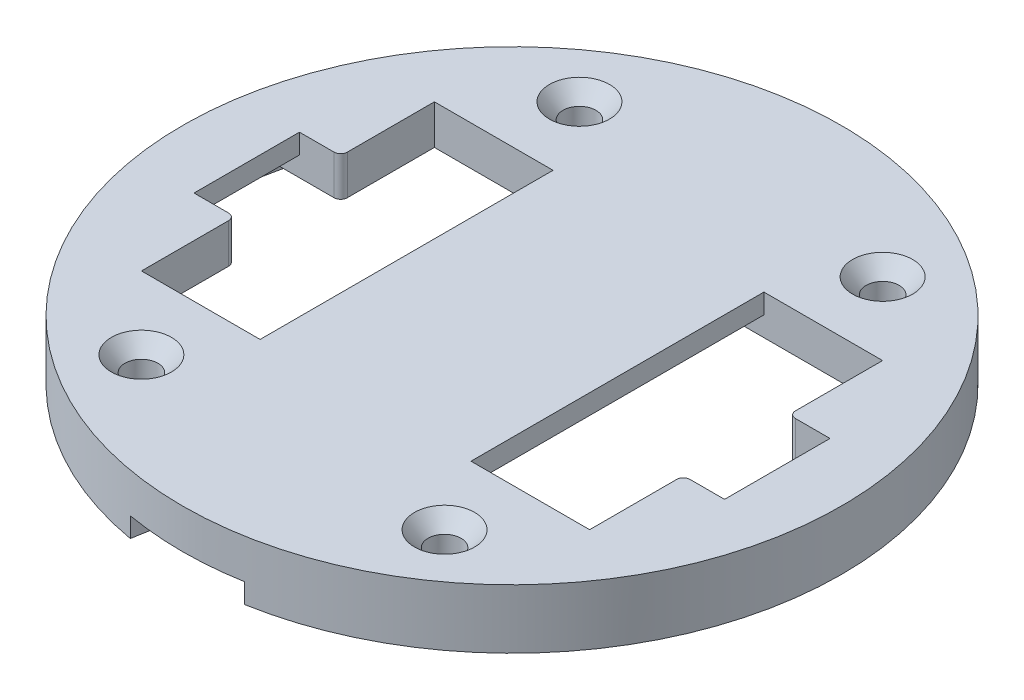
ISO-10303-21;
HEADER;
FILE_DESCRIPTION(('STEP AP214'),'2;1');
FILE_NAME('part.step','',(''),(''),'','','');
FILE_SCHEMA(('AUTOMOTIVE_DESIGN { 1 0 10303 214 1 1 1 1 }'));
ENDSEC;
DATA;
#1=APPLICATION_CONTEXT('core data for automotive mechanical design processes');
#2=APPLICATION_PROTOCOL_DEFINITION('international standard','automotive_design',2000,#1);
#3=PRODUCT_CONTEXT('',#1,'mechanical');
#4=PRODUCT('Part','Part','',(#3));
#5=PRODUCT_RELATED_PRODUCT_CATEGORY('part','',(#4));
#6=PRODUCT_DEFINITION_FORMATION('','',#4);
#7=PRODUCT_DEFINITION_CONTEXT('part definition',#1,'design');
#8=PRODUCT_DEFINITION('design','',#6,#7);
#9=PRODUCT_DEFINITION_SHAPE('','',#8);
#10=(LENGTH_UNIT() NAMED_UNIT(*) SI_UNIT(.MILLI.,.METRE.));
#11=(NAMED_UNIT(*) PLANE_ANGLE_UNIT() SI_UNIT($,.RADIAN.));
#12=(NAMED_UNIT(*) SI_UNIT($,.STERADIAN.) SOLID_ANGLE_UNIT());
#13=UNCERTAINTY_MEASURE_WITH_UNIT(LENGTH_MEASURE(1.E-05),#10,'distance_accuracy_value','');
#14=(GEOMETRIC_REPRESENTATION_CONTEXT(3) GLOBAL_UNCERTAINTY_ASSIGNED_CONTEXT((#13)) GLOBAL_UNIT_ASSIGNED_CONTEXT((#10,
#11,#12)) REPRESENTATION_CONTEXT('',''));
#15=CARTESIAN_POINT('',(0.,0.,0.));
#16=DIRECTION('',(0.,0.,1.));
#17=DIRECTION('',(1.,0.,0.));
#18=AXIS2_PLACEMENT_3D('',#15,#16,#17);
#19=CARTESIAN_POINT('',(0.,0.,0.));
#20=DIRECTION('',(0.,1.,0.));
#21=DIRECTION('',(0.,0.,1.));
#22=AXIS2_PLACEMENT_3D('',#19,#20,#21);
#23=PLANE('',#22);
#24=DIRECTION('',(0.,0.,-1.));
#25=VECTOR('',#24,1.);
#26=CARTESIAN_POINT('',(-43.25,0.,-8.));
#27=LINE('',#26,#25);
#28=CARTESIAN_POINT('',(-43.25,0.,8.));
#29=VERTEX_POINT('',#28);
#30=CARTESIAN_POINT('',(-43.25,0.,-8.));
#31=VERTEX_POINT('',#30);
#32=EDGE_CURVE('E616',#29,#31,#27,.T.);
#33=ORIENTED_EDGE('',*,*,#32,.T.);
#34=DIRECTION('',(1.,0.,0.));
#35=VECTOR('',#34,1.);
#36=CARTESIAN_POINT('',(-34.,0.,-8.));
#37=LINE('',#36,#35);
#38=CARTESIAN_POINT('',(-40.25,0.,-8.));
#39=VERTEX_POINT('',#38);
#40=EDGE_CURVE('E619',#31,#39,#37,.T.);
#41=ORIENTED_EDGE('',*,*,#40,.T.);
#42=DIRECTION('',(0.,0.,-1.));
#43=VECTOR('',#42,1.);
#44=CARTESIAN_POINT('',(-40.25,0.,-8.));
#45=LINE('',#44,#43);
#46=CARTESIAN_POINT('',(-40.25,0.,8.));
#47=VERTEX_POINT('',#46);
#48=EDGE_CURVE('E680',#47,#39,#45,.T.);
#49=ORIENTED_EDGE('',*,*,#48,.F.);
#50=DIRECTION('',(-1.,0.,0.));
#51=VECTOR('',#50,1.);
#52=CARTESIAN_POINT('',(-43.25,0.,8.));
#53=LINE('',#52,#51);
#54=EDGE_CURVE('E613',#47,#29,#53,.T.);
#55=ORIENTED_EDGE('',*,*,#54,.T.);
#56=EDGE_LOOP('',(#33,#41,#49,#55));
#57=FACE_BOUND('',#56,.T.);
#58=ADVANCED_FACE('F32',(#57),#23,.F.);
#59=DIRECTION('',(0.,0.,1.));
#60=VECTOR('',#59,1.);
#61=CARTESIAN_POINT('',(-13.,0.,22.225));
#62=LINE('',#61,#60);
#63=CARTESIAN_POINT('',(-13.,0.,-22.225));
#64=VERTEX_POINT('',#63);
#65=CARTESIAN_POINT('',(-13.,0.,22.225));
#66=VERTEX_POINT('',#65);
#67=EDGE_CURVE('E608',#64,#66,#62,.T.);
#68=ORIENTED_EDGE('',*,*,#67,.T.);
#69=DIRECTION('',(-1.,0.,0.));
#70=VECTOR('',#69,1.);
#71=CARTESIAN_POINT('',(-34.,0.,22.225));
#72=LINE('',#71,#70);
#73=CARTESIAN_POINT('',(-16.,0.,22.225));
#74=VERTEX_POINT('',#73);
#75=EDGE_CURVE('E611',#66,#74,#72,.T.);
#76=ORIENTED_EDGE('',*,*,#75,.T.);
#77=DIRECTION('',(0.,0.,1.));
#78=VECTOR('',#77,1.);
#79=CARTESIAN_POINT('',(-16.,0.,22.225));
#80=LINE('',#79,#78);
#81=CARTESIAN_POINT('',(-16.,0.,-22.225));
#82=VERTEX_POINT('',#81);
#83=EDGE_CURVE('E585',#82,#74,#80,.T.);
#84=ORIENTED_EDGE('',*,*,#83,.F.);
#85=DIRECTION('',(1.,0.,0.));
#86=VECTOR('',#85,1.);
#87=CARTESIAN_POINT('',(-13.,0.,-22.225));
#88=LINE('',#87,#86);
#89=EDGE_CURVE('E605',#82,#64,#88,.T.);
#90=ORIENTED_EDGE('',*,*,#89,.T.);
#91=EDGE_LOOP('',(#68,#76,#84,#90));
#92=FACE_BOUND('',#91,.T.);
#93=ADVANCED_FACE('F1144',(#92),#23,.F.);
#94=DIRECTION('',(0.,0.,1.));
#95=VECTOR('',#94,1.);
#96=CARTESIAN_POINT('',(43.25,0.,8.));
#97=LINE('',#96,#95);
#98=CARTESIAN_POINT('',(43.25,0.,-8.));
#99=VERTEX_POINT('',#98);
#100=CARTESIAN_POINT('',(43.25,0.,8.));
#101=VERTEX_POINT('',#100);
#102=EDGE_CURVE('E597',#99,#101,#97,.T.);
#103=ORIENTED_EDGE('',*,*,#102,.T.);
#104=DIRECTION('',(-1.,0.,0.));
#105=VECTOR('',#104,1.);
#106=CARTESIAN_POINT('',(34.,0.,8.));
#107=LINE('',#106,#105);
#108=CARTESIAN_POINT('',(40.25,0.,8.));
#109=VERTEX_POINT('',#108);
#110=EDGE_CURVE('E476',#101,#109,#107,.T.);
#111=ORIENTED_EDGE('',*,*,#110,.T.);
#112=DIRECTION('',(0.,0.,1.));
#113=VECTOR('',#112,1.);
#114=CARTESIAN_POINT('',(40.25,0.,-8.));
#115=LINE('',#114,#113);
#116=CARTESIAN_POINT('',(40.25,0.,-8.));
#117=VERTEX_POINT('',#116);
#118=EDGE_CURVE('E708',#117,#109,#115,.T.);
#119=ORIENTED_EDGE('',*,*,#118,.F.);
#120=DIRECTION('',(1.,0.,0.));
#121=VECTOR('',#120,1.);
#122=CARTESIAN_POINT('',(43.25,0.,-8.));
#123=LINE('',#122,#121);
#124=EDGE_CURVE('E594',#117,#99,#123,.T.);
#125=ORIENTED_EDGE('',*,*,#124,.T.);
#126=EDGE_LOOP('',(#103,#111,#119,#125));
#127=FACE_BOUND('',#126,.T.);
#128=ADVANCED_FACE('F1150',(#127),#23,.F.);
#129=CARTESIAN_POINT('',(0.,-6.,0.));
#130=DIRECTION('',(0.,1.,0.));
#131=DIRECTION('',(0.,0.,1.));
#132=AXIS2_PLACEMENT_3D('',#129,#130,#131);
#133=CYLINDRICAL_SURFACE('',#132,47.);
#134=CARTESIAN_POINT('',(0.,-3.,0.));
#135=DIRECTION('',(0.,-1.,0.));
#136=DIRECTION('',(0.,0.,-1.));
#137=AXIS2_PLACEMENT_3D('',#134,#135,#136);
#138=CIRCLE('',#137,47.);
#139=CARTESIAN_POINT('',(8.16146435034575,-3.,-46.2859643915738));
#140=VERTEX_POINT('',#139);
#141=CARTESIAN_POINT('',(8.16146435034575,-3.,46.2859643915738));
#142=VERTEX_POINT('',#141);
#143=EDGE_CURVE('E583',#140,#142,#138,.T.);
#144=ORIENTED_EDGE('',*,*,#143,.F.);
#145=DIRECTION('',(0.,-1.,0.));
#146=VECTOR('',#145,1.);
#147=CARTESIAN_POINT('',(8.16146435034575,-3.,-46.2859643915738));
#148=LINE('',#147,#146);
#149=CARTESIAN_POINT('',(8.16146435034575,-6.,-46.2859643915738));
#150=VERTEX_POINT('',#149);
#151=EDGE_CURVE('E778',#140,#150,#148,.T.);
#152=ORIENTED_EDGE('',*,*,#151,.T.);
#153=CARTESIAN_POINT('',(0.,-6.,0.));
#154=DIRECTION('',(0.,-1.,0.));
#155=DIRECTION('',(0.,0.,-1.));
#156=AXIS2_PLACEMENT_3D('',#153,#154,#155);
#157=CIRCLE('',#156,47.);
#158=CARTESIAN_POINT('',(8.16146435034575,-6.,46.2859643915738));
#159=VERTEX_POINT('',#158);
#160=EDGE_CURVE('E804',#150,#159,#157,.T.);
#161=ORIENTED_EDGE('',*,*,#160,.T.);
#162=DIRECTION('',(0.,-1.,0.));
#163=VECTOR('',#162,1.);
#164=CARTESIAN_POINT('',(8.16146435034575,-3.,46.2859643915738));
#165=LINE('',#164,#163);
#166=EDGE_CURVE('E797',#142,#159,#165,.T.);
#167=ORIENTED_EDGE('',*,*,#166,.F.);
#168=EDGE_LOOP('',(#144,#152,#161,#167));
#169=FACE_BOUND('',#168,.T.);
#170=ADVANCED_FACE('F1181',(#169),#133,.F.);
#171=CARTESIAN_POINT('',(0.,-6.,0.));
#172=DIRECTION('',(0.,-1.,0.));
#173=DIRECTION('',(0.,0.,-1.));
#174=AXIS2_PLACEMENT_3D('',#171,#172,#173);
#175=PLANE('',#174);
#176=DIRECTION('',(-0.17364817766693,0.,0.984807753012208));
#177=VECTOR('',#176,1.);
#178=CARTESIAN_POINT('',(8.68240888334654,-6.,-49.2403876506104));
#179=LINE('',#178,#177);
#180=CARTESIAN_POINT('',(8.68240888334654,-6.,-49.2403876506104));
#181=VERTEX_POINT('',#180);
#182=EDGE_CURVE('E770',#181,#150,#179,.T.);
#183=ORIENTED_EDGE('',*,*,#182,.F.);
#184=CARTESIAN_POINT('',(0.,-6.,0.));
#185=DIRECTION('',(0.,-1.,0.));
#186=DIRECTION('',(0.,0.,-1.));
#187=AXIS2_PLACEMENT_3D('',#184,#185,#186);
#188=CIRCLE('',#187,50.);
#189=CARTESIAN_POINT('',(8.68240888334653,-6.,49.2403876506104));
#190=VERTEX_POINT('',#189);
#191=EDGE_CURVE('E815',#181,#190,#188,.T.);
#192=ORIENTED_EDGE('',*,*,#191,.T.);
#193=DIRECTION('',(0.17364817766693,0.,0.984807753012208));
#194=VECTOR('',#193,1.);
#195=CARTESIAN_POINT('',(8.68240888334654,-6.,49.2403876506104));
#196=LINE('',#195,#194);
#197=EDGE_CURVE('E781',#159,#190,#196,.T.);
#198=ORIENTED_EDGE('',*,*,#197,.F.);
#199=ORIENTED_EDGE('',*,*,#160,.F.);
#200=EDGE_LOOP('',(#183,#192,#198,#199));
#201=FACE_BOUND('',#200,.T.);
#202=ADVANCED_FACE('F1186',(#201),#175,.T.);
#203=CARTESIAN_POINT('',(0.,3.,0.));
#204=DIRECTION('',(0.,-1.,0.));
#205=DIRECTION('',(0.,0.,-1.));
#206=AXIS2_PLACEMENT_3D('',#203,#204,#205);
#207=CYLINDRICAL_SURFACE('',#206,50.);
#208=ORIENTED_EDGE('',*,*,#191,.F.);
#209=DIRECTION('',(0.,-1.,0.));
#210=VECTOR('',#209,1.);
#211=CARTESIAN_POINT('',(8.68240888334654,-3.,-49.2403876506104));
#212=LINE('',#211,#210);
#213=CARTESIAN_POINT('',(8.68240888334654,-3.,-49.2403876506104));
#214=VERTEX_POINT('',#213);
#215=EDGE_CURVE('E782',#214,#181,#212,.T.);
#216=ORIENTED_EDGE('',*,*,#215,.F.);
#217=CARTESIAN_POINT('',(0.,-3.,0.));
#218=DIRECTION('',(0.,-1.,0.));
#219=DIRECTION('',(0.,0.,1.));
#220=AXIS2_PLACEMENT_3D('',#217,#218,#219);
#221=CIRCLE('',#220,50.);
#222=CARTESIAN_POINT('',(-8.68240888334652,-3.,-49.2403876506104));
#223=VERTEX_POINT('',#222);
#224=EDGE_CURVE('E769',#223,#214,#221,.T.);
#225=ORIENTED_EDGE('',*,*,#224,.F.);
#226=DIRECTION('',(0.,-1.,0.));
#227=VECTOR('',#226,1.);
#228=CARTESIAN_POINT('',(-8.68240888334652,-3.,-49.2403876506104));
#229=LINE('',#228,#227);
#230=CARTESIAN_POINT('',(-8.68240888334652,-6.,-49.2403876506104));
#231=VERTEX_POINT('',#230);
#232=EDGE_CURVE('E784',#223,#231,#229,.T.);
#233=ORIENTED_EDGE('',*,*,#232,.T.);
#234=CARTESIAN_POINT('',(-8.68240888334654,-6.,49.2403876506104));
#235=VERTEX_POINT('',#234);
#236=EDGE_CURVE('E816',#235,#231,#188,.T.);
#237=ORIENTED_EDGE('',*,*,#236,.F.);
#238=DIRECTION('',(0.,-1.,0.));
#239=VECTOR('',#238,1.);
#240=CARTESIAN_POINT('',(-8.68240888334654,-3.,49.2403876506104));
#241=LINE('',#240,#239);
#242=CARTESIAN_POINT('',(-8.68240888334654,-3.,49.2403876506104));
#243=VERTEX_POINT('',#242);
#244=EDGE_CURVE('E805',#243,#235,#241,.T.);
#245=ORIENTED_EDGE('',*,*,#244,.F.);
#246=CARTESIAN_POINT('',(0.,-3.,0.));
#247=DIRECTION('',(0.,-1.,0.));
#248=DIRECTION('',(0.,0.,-1.));
#249=AXIS2_PLACEMENT_3D('',#246,#247,#248);
#250=CIRCLE('',#249,50.);
#251=CARTESIAN_POINT('',(8.68240888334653,-3.,49.2403876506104));
#252=VERTEX_POINT('',#251);
#253=EDGE_CURVE('E791',#252,#243,#250,.T.);
#254=ORIENTED_EDGE('',*,*,#253,.F.);
#255=DIRECTION('',(0.,-1.,0.));
#256=VECTOR('',#255,1.);
#257=CARTESIAN_POINT('',(8.68240888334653,-3.,49.2403876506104));
#258=LINE('',#257,#256);
#259=EDGE_CURVE('E807',#252,#190,#258,.T.);
#260=ORIENTED_EDGE('',*,*,#259,.T.);
#261=EDGE_LOOP('',(#208,#216,#225,#233,#237,#245,#254,#260));
#262=FACE_BOUND('',#261,.T.);
#263=CARTESIAN_POINT('',(0.,3.,0.));
#264=DIRECTION('',(0.,1.,0.));
#265=DIRECTION('',(0.,0.,1.));
#266=AXIS2_PLACEMENT_3D('',#263,#264,#265);
#267=CIRCLE('',#266,50.);
#268=CARTESIAN_POINT('',(0.,3.,50.));
#269=VERTEX_POINT('',#268);
#270=EDGE_CURVE('E819',#269,#269,#267,.T.);
#271=ORIENTED_EDGE('',*,*,#270,.F.);
#272=EDGE_LOOP('',(#271));
#273=FACE_BOUND('',#272,.T.);
#274=ADVANCED_FACE('F1178',(#262,#273),#207,.T.);
#275=CARTESIAN_POINT('',(0.,3.,0.));
#276=DIRECTION('',(0.,1.,0.));
#277=DIRECTION('',(0.,0.,1.));
#278=AXIS2_PLACEMENT_3D('',#275,#276,#277);
#279=PLANE('',#278);
#280=CARTESIAN_POINT('',(-23.,3.,-33.2340187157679));
#281=DIRECTION('',(0.,1.,0.));
#282=DIRECTION('',(0.,0.,1.));
#283=AXIS2_PLACEMENT_3D('',#280,#281,#282);
#284=CIRCLE('',#283,4.5593);
#285=CARTESIAN_POINT('',(-23.,3.,-28.6747187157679));
#286=VERTEX_POINT('',#285);
#287=EDGE_CURVE('E1648',#286,#286,#284,.T.);
#288=ORIENTED_EDGE('',*,*,#287,.F.);
#289=EDGE_LOOP('',(#288));
#290=FACE_BOUND('',#289,.T.);
#291=CARTESIAN_POINT('',(23.,3.,-33.2340187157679));
#292=DIRECTION('',(0.,1.,0.));
#293=DIRECTION('',(0.,0.,1.));
#294=AXIS2_PLACEMENT_3D('',#291,#292,#293);
#295=CIRCLE('',#294,4.5593);
#296=CARTESIAN_POINT('',(23.,3.,-28.6747187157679));
#297=VERTEX_POINT('',#296);
#298=EDGE_CURVE('E1300',#297,#297,#295,.T.);
#299=ORIENTED_EDGE('',*,*,#298,.F.);
#300=EDGE_LOOP('',(#299));
#301=FACE_BOUND('',#300,.T.);
#302=CARTESIAN_POINT('',(23.,3.,33.2340187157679));
#303=DIRECTION('',(0.,1.,0.));
#304=DIRECTION('',(0.,0.,1.));
#305=AXIS2_PLACEMENT_3D('',#302,#303,#304);
#306=CIRCLE('',#305,4.5593);
#307=CARTESIAN_POINT('',(23.,3.,37.7933187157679));
#308=VERTEX_POINT('',#307);
#309=EDGE_CURVE('E1299',#308,#308,#306,.T.);
#310=ORIENTED_EDGE('',*,*,#309,.F.);
#311=EDGE_LOOP('',(#310));
#312=FACE_BOUND('',#311,.T.);
#313=CARTESIAN_POINT('',(-23.,3.,33.2340187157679));
#314=DIRECTION('',(0.,1.,0.));
#315=DIRECTION('',(0.,0.,1.));
#316=AXIS2_PLACEMENT_3D('',#313,#314,#315);
#317=CIRCLE('',#316,4.5593);
#318=CARTESIAN_POINT('',(-23.,3.,37.7933187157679));
#319=VERTEX_POINT('',#318);
#320=EDGE_CURVE('E1311',#319,#319,#317,.T.);
#321=ORIENTED_EDGE('',*,*,#320,.F.);
#322=EDGE_LOOP('',(#321));
#323=FACE_BOUND('',#322,.T.);
#324=DIRECTION('',(1.,0.,0.));
#325=VECTOR('',#324,1.);
#326=CARTESIAN_POINT('',(-34.,3.,-8.));
#327=LINE('',#326,#325);
#328=CARTESIAN_POINT('',(-40.25,3.,-8.));
#329=VERTEX_POINT('',#328);
#330=CARTESIAN_POINT('',(-35.,3.,-8.));
#331=VERTEX_POINT('',#330);
#332=EDGE_CURVE('E697',#329,#331,#327,.T.);
#333=ORIENTED_EDGE('',*,*,#332,.T.);
#334=CARTESIAN_POINT('',(-35.,3.,-9.));
#335=DIRECTION('',(0.,1.,0.));
#336=DIRECTION('',(0.,0.,1.));
#337=AXIS2_PLACEMENT_3D('',#334,#335,#336);
#338=CIRCLE('',#337,1.);
#339=CARTESIAN_POINT('',(-34.,3.,-9.));
#340=VERTEX_POINT('',#339);
#341=EDGE_CURVE('E844',#331,#340,#338,.T.);
#342=ORIENTED_EDGE('',*,*,#341,.T.);
#343=DIRECTION('',(0.,0.,-1.));
#344=VECTOR('',#343,1.);
#345=CARTESIAN_POINT('',(-34.,3.,-22.225));
#346=LINE('',#345,#344);
#347=CARTESIAN_POINT('',(-34.,3.,-22.225));
#348=VERTEX_POINT('',#347);
#349=EDGE_CURVE('E677',#340,#348,#346,.T.);
#350=ORIENTED_EDGE('',*,*,#349,.T.);
#351=DIRECTION('',(1.,0.,0.));
#352=VECTOR('',#351,1.);
#353=CARTESIAN_POINT('',(-16.,3.,-22.225));
#354=LINE('',#353,#352);
#355=CARTESIAN_POINT('',(-16.,3.,-22.225));
#356=VERTEX_POINT('',#355);
#357=EDGE_CURVE('E679',#348,#356,#354,.T.);
#358=ORIENTED_EDGE('',*,*,#357,.T.);
#359=DIRECTION('',(0.,0.,1.));
#360=VECTOR('',#359,1.);
#361=CARTESIAN_POINT('',(-16.,3.,22.225));
#362=LINE('',#361,#360);
#363=CARTESIAN_POINT('',(-16.,3.,22.225));
#364=VERTEX_POINT('',#363);
#365=EDGE_CURVE('E683',#356,#364,#362,.T.);
#366=ORIENTED_EDGE('',*,*,#365,.T.);
#367=DIRECTION('',(-1.,0.,0.));
#368=VECTOR('',#367,1.);
#369=CARTESIAN_POINT('',(-34.,3.,22.225));
#370=LINE('',#369,#368);
#371=CARTESIAN_POINT('',(-34.,3.,22.225));
#372=VERTEX_POINT('',#371);
#373=EDGE_CURVE('E686',#364,#372,#370,.T.);
#374=ORIENTED_EDGE('',*,*,#373,.T.);
#375=DIRECTION('',(0.,0.,-1.));
#376=VECTOR('',#375,1.);
#377=CARTESIAN_POINT('',(-34.,3.,8.));
#378=LINE('',#377,#376);
#379=CARTESIAN_POINT('',(-34.,3.,9.));
#380=VERTEX_POINT('',#379);
#381=EDGE_CURVE('E689',#372,#380,#378,.T.);
#382=ORIENTED_EDGE('',*,*,#381,.T.);
#383=CARTESIAN_POINT('',(-35.,3.,9.));
#384=DIRECTION('',(0.,1.,0.));
#385=DIRECTION('',(0.,0.,1.));
#386=AXIS2_PLACEMENT_3D('',#383,#384,#385);
#387=CIRCLE('',#386,1.);
#388=CARTESIAN_POINT('',(-35.,3.,8.));
#389=VERTEX_POINT('',#388);
#390=EDGE_CURVE('E842',#380,#389,#387,.T.);
#391=ORIENTED_EDGE('',*,*,#390,.T.);
#392=DIRECTION('',(-1.,0.,0.));
#393=VECTOR('',#392,1.);
#394=CARTESIAN_POINT('',(-40.25,3.,8.));
#395=LINE('',#394,#393);
#396=CARTESIAN_POINT('',(-40.25,3.,8.));
#397=VERTEX_POINT('',#396);
#398=EDGE_CURVE('E692',#389,#397,#395,.T.);
#399=ORIENTED_EDGE('',*,*,#398,.T.);
#400=DIRECTION('',(0.,0.,-1.));
#401=VECTOR('',#400,1.);
#402=CARTESIAN_POINT('',(-40.25,3.,-8.));
#403=LINE('',#402,#401);
#404=EDGE_CURVE('E694',#397,#329,#403,.T.);
#405=ORIENTED_EDGE('',*,*,#404,.T.);
#406=EDGE_LOOP('',(#333,#342,#350,#358,#366,#374,#382,#391,#399,#405));
#407=FACE_BOUND('',#406,.T.);
#408=DIRECTION('',(0.,0.,1.));
#409=VECTOR('',#408,1.);
#410=CARTESIAN_POINT('',(34.,3.,-22.225));
#411=LINE('',#410,#409);
#412=CARTESIAN_POINT('',(34.,3.,-22.225));
#413=VERTEX_POINT('',#412);
#414=CARTESIAN_POINT('',(34.,3.,-9.));
#415=VERTEX_POINT('',#414);
#416=EDGE_CURVE('E742',#413,#415,#411,.T.);
#417=ORIENTED_EDGE('',*,*,#416,.T.);
#418=CARTESIAN_POINT('',(35.,3.,-9.));
#419=DIRECTION('',(0.,1.,0.));
#420=DIRECTION('',(0.,0.,1.));
#421=AXIS2_PLACEMENT_3D('',#418,#419,#420);
#422=CIRCLE('',#421,1.);
#423=CARTESIAN_POINT('',(35.,3.,-8.));
#424=VERTEX_POINT('',#423);
#425=EDGE_CURVE('E848',#415,#424,#422,.T.);
#426=ORIENTED_EDGE('',*,*,#425,.T.);
#427=DIRECTION('',(1.,0.,0.));
#428=VECTOR('',#427,1.);
#429=CARTESIAN_POINT('',(34.,3.,-8.));
#430=LINE('',#429,#428);
#431=CARTESIAN_POINT('',(40.25,3.,-8.));
#432=VERTEX_POINT('',#431);
#433=EDGE_CURVE('E722',#424,#432,#430,.T.);
#434=ORIENTED_EDGE('',*,*,#433,.T.);
#435=DIRECTION('',(0.,0.,1.));
#436=VECTOR('',#435,1.);
#437=CARTESIAN_POINT('',(40.25,3.,-8.));
#438=LINE('',#437,#436);
#439=CARTESIAN_POINT('',(40.25,3.,8.));
#440=VERTEX_POINT('',#439);
#441=EDGE_CURVE('E724',#432,#440,#438,.T.);
#442=ORIENTED_EDGE('',*,*,#441,.T.);
#443=DIRECTION('',(-1.,0.,0.));
#444=VECTOR('',#443,1.);
#445=CARTESIAN_POINT('',(40.25,3.,8.));
#446=LINE('',#445,#444);
#447=CARTESIAN_POINT('',(35.,3.,8.));
#448=VERTEX_POINT('',#447);
#449=EDGE_CURVE('E728',#440,#448,#446,.T.);
#450=ORIENTED_EDGE('',*,*,#449,.T.);
#451=CARTESIAN_POINT('',(35.,3.,9.));
#452=DIRECTION('',(0.,1.,0.));
#453=DIRECTION('',(0.,0.,1.));
#454=AXIS2_PLACEMENT_3D('',#451,#452,#453);
#455=CIRCLE('',#454,1.);
#456=CARTESIAN_POINT('',(34.,3.,9.));
#457=VERTEX_POINT('',#456);
#458=EDGE_CURVE('E846',#448,#457,#455,.T.);
#459=ORIENTED_EDGE('',*,*,#458,.T.);
#460=DIRECTION('',(0.,0.,1.));
#461=VECTOR('',#460,1.);
#462=CARTESIAN_POINT('',(34.,3.,8.));
#463=LINE('',#462,#461);
#464=CARTESIAN_POINT('',(34.,3.,22.225));
#465=VERTEX_POINT('',#464);
#466=EDGE_CURVE('E731',#457,#465,#463,.T.);
#467=ORIENTED_EDGE('',*,*,#466,.T.);
#468=DIRECTION('',(-1.,0.,0.));
#469=VECTOR('',#468,1.);
#470=CARTESIAN_POINT('',(34.,3.,22.225));
#471=LINE('',#470,#469);
#472=CARTESIAN_POINT('',(16.,3.,22.225));
#473=VERTEX_POINT('',#472);
#474=EDGE_CURVE('E733',#465,#473,#471,.T.);
#475=ORIENTED_EDGE('',*,*,#474,.T.);
#476=DIRECTION('',(0.,0.,-1.));
#477=VECTOR('',#476,1.);
#478=CARTESIAN_POINT('',(16.,3.,22.225));
#479=LINE('',#478,#477);
#480=CARTESIAN_POINT('',(16.,3.,-22.225));
#481=VERTEX_POINT('',#480);
#482=EDGE_CURVE('E736',#473,#481,#479,.T.);
#483=ORIENTED_EDGE('',*,*,#482,.T.);
#484=DIRECTION('',(1.,0.,0.));
#485=VECTOR('',#484,1.);
#486=CARTESIAN_POINT('',(16.,3.,-22.225));
#487=LINE('',#486,#485);
#488=EDGE_CURVE('E739',#481,#413,#487,.T.);
#489=ORIENTED_EDGE('',*,*,#488,.T.);
#490=EDGE_LOOP('',(#417,#426,#434,#442,#450,#459,#467,#475,#483,#489));
#491=FACE_BOUND('',#490,.T.);
#492=ORIENTED_EDGE('',*,*,#270,.T.);
#493=EDGE_LOOP('',(#492));
#494=FACE_BOUND('',#493,.T.);
#495=ADVANCED_FACE('F1169',(#290,#301,#312,#323,#407,#491,#494),#279,.T.);
#496=DIRECTION('',(0.,0.,-1.));
#497=VECTOR('',#496,1.);
#498=CARTESIAN_POINT('',(13.,0.,-22.225));
#499=LINE('',#498,#497);
#500=CARTESIAN_POINT('',(13.,0.,22.225));
#501=VERTEX_POINT('',#500);
#502=CARTESIAN_POINT('',(13.,0.,-22.225));
#503=VERTEX_POINT('',#502);
#504=EDGE_CURVE('E589',#501,#503,#499,.T.);
#505=ORIENTED_EDGE('',*,*,#504,.T.);
#506=DIRECTION('',(1.,0.,0.));
#507=VECTOR('',#506,1.);
#508=CARTESIAN_POINT('',(34.,0.,-22.225));
#509=LINE('',#508,#507);
#510=CARTESIAN_POINT('',(16.,0.,-22.225));
#511=VERTEX_POINT('',#510);
#512=EDGE_CURVE('E592',#503,#511,#509,.T.);
#513=ORIENTED_EDGE('',*,*,#512,.T.);
#514=DIRECTION('',(0.,0.,-1.));
#515=VECTOR('',#514,1.);
#516=CARTESIAN_POINT('',(16.,0.,22.225));
#517=LINE('',#516,#515);
#518=CARTESIAN_POINT('',(16.,0.,22.225));
#519=VERTEX_POINT('',#518);
#520=EDGE_CURVE('E725',#519,#511,#517,.T.);
#521=ORIENTED_EDGE('',*,*,#520,.F.);
#522=DIRECTION('',(-1.,0.,0.));
#523=VECTOR('',#522,1.);
#524=CARTESIAN_POINT('',(13.,0.,22.225));
#525=LINE('',#524,#523);
#526=EDGE_CURVE('E582',#519,#501,#525,.T.);
#527=ORIENTED_EDGE('',*,*,#526,.T.);
#528=EDGE_LOOP('',(#505,#513,#521,#527));
#529=FACE_BOUND('',#528,.T.);
#530=ADVANCED_FACE('F1152',(#529),#23,.F.);
#531=CARTESIAN_POINT('',(-23.,0.,-33.2340187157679));
#532=DIRECTION('',(0.,1.,0.));
#533=DIRECTION('',(0.,0.,1.));
#534=AXIS2_PLACEMENT_3D('',#531,#532,#533);
#535=CYLINDRICAL_SURFACE('',#534,2.5);
#536=CARTESIAN_POINT('',(-23.,0.631046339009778,-33.2340187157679));
#537=DIRECTION('',(0.,1.,0.));
#538=DIRECTION('',(0.,0.,1.));
#539=AXIS2_PLACEMENT_3D('',#536,#537,#538);
#540=CIRCLE('',#539,2.5);
#541=CARTESIAN_POINT('',(-23.,0.631046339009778,-30.7340187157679));
#542=VERTEX_POINT('',#541);
#543=EDGE_CURVE('E1306',#542,#542,#540,.T.);
#544=ORIENTED_EDGE('',*,*,#543,.T.);
#545=EDGE_LOOP('',(#544));
#546=FACE_BOUND('',#545,.T.);
#547=CARTESIAN_POINT('',(-23.,-3.,-33.2340187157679));
#548=DIRECTION('',(0.,-1.,0.));
#549=DIRECTION('',(0.,0.,-1.));
#550=AXIS2_PLACEMENT_3D('',#547,#548,#549);
#551=CIRCLE('',#550,2.5);
#552=CARTESIAN_POINT('',(-23.,-3.,-35.7340187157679));
#553=VERTEX_POINT('',#552);
#554=EDGE_CURVE('E522',#553,#553,#551,.T.);
#555=ORIENTED_EDGE('',*,*,#554,.T.);
#556=EDGE_LOOP('',(#555));
#557=FACE_BOUND('',#556,.T.);
#558=ADVANCED_FACE('F1168',(#546,#557),#535,.F.);
#559=CARTESIAN_POINT('',(23.,0.,-33.2340187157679));
#560=DIRECTION('',(0.,1.,0.));
#561=DIRECTION('',(0.,0.,1.));
#562=AXIS2_PLACEMENT_3D('',#559,#560,#561);
#563=CYLINDRICAL_SURFACE('',#562,2.5);
#564=CARTESIAN_POINT('',(23.,0.631046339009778,-33.2340187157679));
#565=DIRECTION('',(0.,1.,0.));
#566=DIRECTION('',(0.,0.,1.));
#567=AXIS2_PLACEMENT_3D('',#564,#565,#566);
#568=CIRCLE('',#567,2.5);
#569=CARTESIAN_POINT('',(23.,0.631046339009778,-30.7340187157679));
#570=VERTEX_POINT('',#569);
#571=EDGE_CURVE('E1289',#570,#570,#568,.T.);
#572=ORIENTED_EDGE('',*,*,#571,.T.);
#573=EDGE_LOOP('',(#572));
#574=FACE_BOUND('',#573,.T.);
#575=CARTESIAN_POINT('',(23.,-3.,-33.2340187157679));
#576=DIRECTION('',(0.,-1.,0.));
#577=DIRECTION('',(0.,0.,-1.));
#578=AXIS2_PLACEMENT_3D('',#575,#576,#577);
#579=CIRCLE('',#578,2.5);
#580=CARTESIAN_POINT('',(23.,-3.,-35.7340187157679));
#581=VERTEX_POINT('',#580);
#582=EDGE_CURVE('E525',#581,#581,#579,.T.);
#583=ORIENTED_EDGE('',*,*,#582,.T.);
#584=EDGE_LOOP('',(#583));
#585=FACE_BOUND('',#584,.T.);
#586=ADVANCED_FACE('F1175',(#574,#585),#563,.F.);
#587=CARTESIAN_POINT('',(23.,0.,33.2340187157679));
#588=DIRECTION('',(0.,1.,0.));
#589=DIRECTION('',(0.,0.,1.));
#590=AXIS2_PLACEMENT_3D('',#587,#588,#589);
#591=CYLINDRICAL_SURFACE('',#590,2.5);
#592=CARTESIAN_POINT('',(23.,0.631046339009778,33.2340187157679));
#593=DIRECTION('',(0.,1.,0.));
#594=DIRECTION('',(0.,0.,1.));
#595=AXIS2_PLACEMENT_3D('',#592,#593,#594);
#596=CIRCLE('',#595,2.5);
#597=CARTESIAN_POINT('',(23.,0.631046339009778,35.7340187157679));
#598=VERTEX_POINT('',#597);
#599=EDGE_CURVE('E1303',#598,#598,#596,.T.);
#600=ORIENTED_EDGE('',*,*,#599,.T.);
#601=EDGE_LOOP('',(#600));
#602=FACE_BOUND('',#601,.T.);
#603=CARTESIAN_POINT('',(23.,-3.,33.2340187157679));
#604=DIRECTION('',(0.,-1.,0.));
#605=DIRECTION('',(0.,0.,-1.));
#606=AXIS2_PLACEMENT_3D('',#603,#604,#605);
#607=CIRCLE('',#606,2.5);
#608=CARTESIAN_POINT('',(23.,-3.,30.7340187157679));
#609=VERTEX_POINT('',#608);
#610=EDGE_CURVE('E528',#609,#609,#607,.T.);
#611=ORIENTED_EDGE('',*,*,#610,.T.);
#612=EDGE_LOOP('',(#611));
#613=FACE_BOUND('',#612,.T.);
#614=ADVANCED_FACE('F1277',(#602,#613),#591,.F.);
#615=CARTESIAN_POINT('',(-23.,0.,33.2340187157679));
#616=DIRECTION('',(0.,1.,0.));
#617=DIRECTION('',(0.,0.,1.));
#618=AXIS2_PLACEMENT_3D('',#615,#616,#617);
#619=CYLINDRICAL_SURFACE('',#618,2.5);
#620=CARTESIAN_POINT('',(-23.,0.631046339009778,33.2340187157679));
#621=DIRECTION('',(0.,1.,0.));
#622=DIRECTION('',(0.,0.,1.));
#623=AXIS2_PLACEMENT_3D('',#620,#621,#622);
#624=CIRCLE('',#623,2.5);
#625=CARTESIAN_POINT('',(-23.,0.631046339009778,35.7340187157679));
#626=VERTEX_POINT('',#625);
#627=EDGE_CURVE('E36',#626,#626,#624,.T.);
#628=ORIENTED_EDGE('',*,*,#627,.T.);
#629=EDGE_LOOP('',(#628));
#630=FACE_BOUND('',#629,.T.);
#631=CARTESIAN_POINT('',(-23.,-3.,33.2340187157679));
#632=DIRECTION('',(0.,-1.,0.));
#633=DIRECTION('',(0.,0.,-1.));
#634=AXIS2_PLACEMENT_3D('',#631,#632,#633);
#635=CIRCLE('',#634,2.5);
#636=CARTESIAN_POINT('',(-23.,-3.,30.7340187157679));
#637=VERTEX_POINT('',#636);
#638=EDGE_CURVE('E531',#637,#637,#635,.T.);
#639=ORIENTED_EDGE('',*,*,#638,.T.);
#640=EDGE_LOOP('',(#639));
#641=FACE_BOUND('',#640,.T.);
#642=ADVANCED_FACE('F1273',(#630,#641),#619,.F.);
#643=DIRECTION('',(-0.17364817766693,0.,-0.984807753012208));
#644=VECTOR('',#643,1.);
#645=CARTESIAN_POINT('',(-8.68240888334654,-6.,-49.2403876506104));
#646=LINE('',#645,#644);
#647=CARTESIAN_POINT('',(-8.16146435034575,-6.,-46.2859643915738));
#648=VERTEX_POINT('',#647);
#649=EDGE_CURVE('E752',#648,#231,#646,.T.);
#650=ORIENTED_EDGE('',*,*,#649,.F.);
#651=CARTESIAN_POINT('',(-8.16146435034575,-6.,46.2859643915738));
#652=VERTEX_POINT('',#651);
#653=EDGE_CURVE('E812',#652,#648,#157,.T.);
#654=ORIENTED_EDGE('',*,*,#653,.F.);
#655=DIRECTION('',(0.17364817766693,0.,-0.984807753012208));
#656=VECTOR('',#655,1.);
#657=CARTESIAN_POINT('',(-8.68240888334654,-6.,49.2403876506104));
#658=LINE('',#657,#656);
#659=EDGE_CURVE('E792',#235,#652,#658,.T.);
#660=ORIENTED_EDGE('',*,*,#659,.F.);
#661=ORIENTED_EDGE('',*,*,#236,.T.);
#662=EDGE_LOOP('',(#650,#654,#660,#661));
#663=FACE_BOUND('',#662,.T.);
#664=ADVANCED_FACE('F1269',(#663),#175,.T.);
#665=CARTESIAN_POINT('',(-8.16146435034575,-3.,46.2859643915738));
#666=VERTEX_POINT('',#665);
#667=CARTESIAN_POINT('',(-8.16146435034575,-3.,-46.2859643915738));
#668=VERTEX_POINT('',#667);
#669=EDGE_CURVE('E586',#666,#668,#138,.T.);
#670=ORIENTED_EDGE('',*,*,#669,.F.);
#671=DIRECTION('',(0.,-1.,0.));
#672=VECTOR('',#671,1.);
#673=CARTESIAN_POINT('',(-8.16146435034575,-3.,46.2859643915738));
#674=LINE('',#673,#672);
#675=EDGE_CURVE('E801',#666,#652,#674,.T.);
#676=ORIENTED_EDGE('',*,*,#675,.T.);
#677=ORIENTED_EDGE('',*,*,#653,.T.);
#678=DIRECTION('',(0.,-1.,0.));
#679=VECTOR('',#678,1.);
#680=CARTESIAN_POINT('',(-8.16146435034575,-3.,-46.2859643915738));
#681=LINE('',#680,#679);
#682=EDGE_CURVE('E775',#668,#648,#681,.T.);
#683=ORIENTED_EDGE('',*,*,#682,.F.);
#684=EDGE_LOOP('',(#670,#676,#677,#683));
#685=FACE_BOUND('',#684,.T.);
#686=ADVANCED_FACE('F1189',(#685),#133,.F.);
#687=CARTESIAN_POINT('',(-8.68240888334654,-3.,49.2403876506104));
#688=DIRECTION('',(-0.984807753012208,0.,-0.17364817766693));
#689=DIRECTION('',(-0.17364817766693,0.,0.984807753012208));
#690=AXIS2_PLACEMENT_3D('',#687,#688,#689);
#691=PLANE('',#690);
#692=ORIENTED_EDGE('',*,*,#659,.T.);
#693=ORIENTED_EDGE('',*,*,#675,.F.);
#694=DIRECTION('',(0.17364817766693,0.,-0.984807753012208));
#695=VECTOR('',#694,1.);
#696=CARTESIAN_POINT('',(-8.68240888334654,-3.,49.2403876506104));
#697=LINE('',#696,#695);
#698=EDGE_CURVE('E794',#243,#666,#697,.T.);
#699=ORIENTED_EDGE('',*,*,#698,.F.);
#700=ORIENTED_EDGE('',*,*,#244,.T.);
#701=EDGE_LOOP('',(#692,#693,#699,#700));
#702=FACE_BOUND('',#701,.T.);
#703=ADVANCED_FACE('F1261',(#702),#691,.F.);
#704=CARTESIAN_POINT('',(8.68240888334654,-3.,49.2403876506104));
#705=DIRECTION('',(0.984807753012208,0.,-0.17364817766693));
#706=DIRECTION('',(-0.17364817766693,0.,-0.984807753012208));
#707=AXIS2_PLACEMENT_3D('',#704,#705,#706);
#708=PLANE('',#707);
#709=ORIENTED_EDGE('',*,*,#197,.T.);
#710=ORIENTED_EDGE('',*,*,#259,.F.);
#711=DIRECTION('',(0.17364817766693,0.,0.984807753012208));
#712=VECTOR('',#711,1.);
#713=CARTESIAN_POINT('',(8.68240888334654,-3.,49.2403876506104));
#714=LINE('',#713,#712);
#715=EDGE_CURVE('E788',#142,#252,#714,.T.);
#716=ORIENTED_EDGE('',*,*,#715,.F.);
#717=ORIENTED_EDGE('',*,*,#166,.T.);
#718=EDGE_LOOP('',(#709,#710,#716,#717));
#719=FACE_BOUND('',#718,.T.);
#720=ADVANCED_FACE('F1259',(#719),#708,.F.);
#721=CARTESIAN_POINT('',(0.,-3.,0.));
#722=DIRECTION('',(0.,-1.,0.));
#723=DIRECTION('',(0.,0.,-1.));
#724=AXIS2_PLACEMENT_3D('',#721,#722,#723);
#725=PLANE('',#724);
#726=ORIENTED_EDGE('',*,*,#698,.T.);
#727=ORIENTED_EDGE('',*,*,#669,.T.);
#728=DIRECTION('',(-0.17364817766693,0.,-0.984807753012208));
#729=VECTOR('',#728,1.);
#730=CARTESIAN_POINT('',(-8.68240888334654,-3.,-49.2403876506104));
#731=LINE('',#730,#729);
#732=EDGE_CURVE('E766',#668,#223,#731,.T.);
#733=ORIENTED_EDGE('',*,*,#732,.T.);
#734=ORIENTED_EDGE('',*,*,#224,.T.);
#735=DIRECTION('',(-0.17364817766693,0.,0.984807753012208));
#736=VECTOR('',#735,1.);
#737=CARTESIAN_POINT('',(8.68240888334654,-3.,-49.2403876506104));
#738=LINE('',#737,#736);
#739=EDGE_CURVE('E772',#214,#140,#738,.T.);
#740=ORIENTED_EDGE('',*,*,#739,.T.);
#741=ORIENTED_EDGE('',*,*,#143,.T.);
#742=ORIENTED_EDGE('',*,*,#715,.T.);
#743=ORIENTED_EDGE('',*,*,#253,.T.);
#744=EDGE_LOOP('',(#726,#727,#733,#734,#740,#741,#742,#743));
#745=FACE_BOUND('',#744,.T.);
#746=DIRECTION('',(1.,0.,0.));
#747=VECTOR('',#746,1.);
#748=CARTESIAN_POINT('',(43.25,-3.,-8.));
#749=LINE('',#748,#747);
#750=CARTESIAN_POINT('',(35.,-3.,-8.));
#751=VERTEX_POINT('',#750);
#752=CARTESIAN_POINT('',(43.25,-3.,-8.));
#753=VERTEX_POINT('',#752);
#754=EDGE_CURVE('E483',#751,#753,#749,.T.);
#755=ORIENTED_EDGE('',*,*,#754,.F.);
#756=CARTESIAN_POINT('',(35.,-3.,-9.));
#757=DIRECTION('',(0.,-1.,0.));
#758=DIRECTION('',(0.,0.,-1.));
#759=AXIS2_PLACEMENT_3D('',#756,#757,#758);
#760=CIRCLE('',#759,1.);
#761=CARTESIAN_POINT('',(34.,-3.,-9.));
#762=VERTEX_POINT('',#761);
#763=EDGE_CURVE('E838',#751,#762,#760,.T.);
#764=ORIENTED_EDGE('',*,*,#763,.T.);
#765=DIRECTION('',(0.,0.,1.));
#766=VECTOR('',#765,1.);
#767=CARTESIAN_POINT('',(34.,-3.,-8.));
#768=LINE('',#767,#766);
#769=CARTESIAN_POINT('',(34.,-3.,-22.225));
#770=VERTEX_POINT('',#769);
#771=EDGE_CURVE('E485',#770,#762,#768,.T.);
#772=ORIENTED_EDGE('',*,*,#771,.F.);
#773=DIRECTION('',(1.,0.,0.));
#774=VECTOR('',#773,1.);
#775=CARTESIAN_POINT('',(34.,-3.,-22.225));
#776=LINE('',#775,#774);
#777=CARTESIAN_POINT('',(13.,-3.,-22.225));
#778=VERTEX_POINT('',#777);
#779=EDGE_CURVE('E491',#778,#770,#776,.T.);
#780=ORIENTED_EDGE('',*,*,#779,.F.);
#781=DIRECTION('',(0.,0.,-1.));
#782=VECTOR('',#781,1.);
#783=CARTESIAN_POINT('',(13.,-3.,-22.225));
#784=LINE('',#783,#782);
#785=CARTESIAN_POINT('',(13.,-3.,22.225));
#786=VERTEX_POINT('',#785);
#787=EDGE_CURVE('E494',#786,#778,#784,.T.);
#788=ORIENTED_EDGE('',*,*,#787,.F.);
#789=DIRECTION('',(-1.,0.,0.));
#790=VECTOR('',#789,1.);
#791=CARTESIAN_POINT('',(13.,-3.,22.225));
#792=LINE('',#791,#790);
#793=CARTESIAN_POINT('',(34.,-3.,22.225));
#794=VERTEX_POINT('',#793);
#795=EDGE_CURVE('E497',#794,#786,#792,.T.);
#796=ORIENTED_EDGE('',*,*,#795,.F.);
#797=DIRECTION('',(0.,0.,1.));
#798=VECTOR('',#797,1.);
#799=CARTESIAN_POINT('',(34.,-3.,22.225));
#800=LINE('',#799,#798);
#801=CARTESIAN_POINT('',(34.,-3.,9.));
#802=VERTEX_POINT('',#801);
#803=EDGE_CURVE('E675',#802,#794,#800,.T.);
#804=ORIENTED_EDGE('',*,*,#803,.F.);
#805=CARTESIAN_POINT('',(35.,-3.,9.));
#806=DIRECTION('',(0.,-1.,0.));
#807=DIRECTION('',(0.,0.,-1.));
#808=AXIS2_PLACEMENT_3D('',#805,#806,#807);
#809=CIRCLE('',#808,1.);
#810=CARTESIAN_POINT('',(35.,-3.,8.));
#811=VERTEX_POINT('',#810);
#812=EDGE_CURVE('E468',#802,#811,#809,.T.);
#813=ORIENTED_EDGE('',*,*,#812,.T.);
#814=DIRECTION('',(-1.,0.,0.));
#815=VECTOR('',#814,1.);
#816=CARTESIAN_POINT('',(34.,-3.,8.));
#817=LINE('',#816,#815);
#818=CARTESIAN_POINT('',(43.25,-3.,8.));
#819=VERTEX_POINT('',#818);
#820=EDGE_CURVE('E459',#819,#811,#817,.T.);
#821=ORIENTED_EDGE('',*,*,#820,.F.);
#822=DIRECTION('',(0.,0.,1.));
#823=VECTOR('',#822,1.);
#824=CARTESIAN_POINT('',(43.25,-3.,8.));
#825=LINE('',#824,#823);
#826=EDGE_CURVE('E465',#753,#819,#825,.T.);
#827=ORIENTED_EDGE('',*,*,#826,.F.);
#828=EDGE_LOOP('',(#755,#764,#772,#780,#788,#796,#804,#813,#821,#827));
#829=FACE_BOUND('',#828,.T.);
#830=DIRECTION('',(0.,0.,-1.));
#831=VECTOR('',#830,1.);
#832=CARTESIAN_POINT('',(-34.,-3.,-22.225));
#833=LINE('',#832,#831);
#834=CARTESIAN_POINT('',(-34.,-3.,-9.));
#835=VERTEX_POINT('',#834);
#836=CARTESIAN_POINT('',(-34.,-3.,-22.225));
#837=VERTEX_POINT('',#836);
#838=EDGE_CURVE('E500',#835,#837,#833,.T.);
#839=ORIENTED_EDGE('',*,*,#838,.F.);
#840=CARTESIAN_POINT('',(-35.,-3.,-9.));
#841=DIRECTION('',(0.,-1.,0.));
#842=DIRECTION('',(0.,0.,-1.));
#843=AXIS2_PLACEMENT_3D('',#840,#841,#842);
#844=CIRCLE('',#843,1.);
#845=CARTESIAN_POINT('',(-35.,-3.,-8.));
#846=VERTEX_POINT('',#845);
#847=EDGE_CURVE('E829',#835,#846,#844,.T.);
#848=ORIENTED_EDGE('',*,*,#847,.T.);
#849=DIRECTION('',(1.,0.,0.));
#850=VECTOR('',#849,1.);
#851=CARTESIAN_POINT('',(-34.,-3.,-8.));
#852=LINE('',#851,#850);
#853=CARTESIAN_POINT('',(-43.25,-3.,-8.));
#854=VERTEX_POINT('',#853);
#855=EDGE_CURVE('E502',#854,#846,#852,.T.);
#856=ORIENTED_EDGE('',*,*,#855,.F.);
#857=DIRECTION('',(0.,0.,-1.));
#858=VECTOR('',#857,1.);
#859=CARTESIAN_POINT('',(-43.25,-3.,-8.));
#860=LINE('',#859,#858);
#861=CARTESIAN_POINT('',(-43.25,-3.,8.));
#862=VERTEX_POINT('',#861);
#863=EDGE_CURVE('E505',#862,#854,#860,.T.);
#864=ORIENTED_EDGE('',*,*,#863,.F.);
#865=DIRECTION('',(-1.,0.,0.));
#866=VECTOR('',#865,1.);
#867=CARTESIAN_POINT('',(-43.25,-3.,8.));
#868=LINE('',#867,#866);
#869=CARTESIAN_POINT('',(-35.,-3.,8.));
#870=VERTEX_POINT('',#869);
#871=EDGE_CURVE('E508',#870,#862,#868,.T.);
#872=ORIENTED_EDGE('',*,*,#871,.F.);
#873=CARTESIAN_POINT('',(-35.,-3.,9.));
#874=DIRECTION('',(0.,-1.,0.));
#875=DIRECTION('',(0.,0.,-1.));
#876=AXIS2_PLACEMENT_3D('',#873,#874,#875);
#877=CIRCLE('',#876,1.);
#878=CARTESIAN_POINT('',(-34.,-3.,9.));
#879=VERTEX_POINT('',#878);
#880=EDGE_CURVE('E827',#870,#879,#877,.T.);
#881=ORIENTED_EDGE('',*,*,#880,.T.);
#882=DIRECTION('',(0.,0.,-1.));
#883=VECTOR('',#882,1.);
#884=CARTESIAN_POINT('',(-34.,-3.,8.));
#885=LINE('',#884,#883);
#886=CARTESIAN_POINT('',(-34.,-3.,22.225));
#887=VERTEX_POINT('',#886);
#888=EDGE_CURVE('E510',#887,#879,#885,.T.);
#889=ORIENTED_EDGE('',*,*,#888,.F.);
#890=DIRECTION('',(-1.,0.,0.));
#891=VECTOR('',#890,1.);
#892=CARTESIAN_POINT('',(-34.,-3.,22.225));
#893=LINE('',#892,#891);
#894=CARTESIAN_POINT('',(-13.,-3.,22.225));
#895=VERTEX_POINT('',#894);
#896=EDGE_CURVE('E513',#895,#887,#893,.T.);
#897=ORIENTED_EDGE('',*,*,#896,.F.);
#898=DIRECTION('',(0.,0.,1.));
#899=VECTOR('',#898,1.);
#900=CARTESIAN_POINT('',(-13.,-3.,22.225));
#901=LINE('',#900,#899);
#902=CARTESIAN_POINT('',(-13.,-3.,-22.225));
#903=VERTEX_POINT('',#902);
#904=EDGE_CURVE('E516',#903,#895,#901,.T.);
#905=ORIENTED_EDGE('',*,*,#904,.F.);
#906=DIRECTION('',(1.,0.,0.));
#907=VECTOR('',#906,1.);
#908=CARTESIAN_POINT('',(-13.,-3.,-22.225));
#909=LINE('',#908,#907);
#910=EDGE_CURVE('E519',#837,#903,#909,.T.);
#911=ORIENTED_EDGE('',*,*,#910,.F.);
#912=EDGE_LOOP('',(#839,#848,#856,#864,#872,#881,#889,#897,#905,#911));
#913=FACE_BOUND('',#912,.T.);
#914=ORIENTED_EDGE('',*,*,#554,.F.);
#915=EDGE_LOOP('',(#914));
#916=FACE_BOUND('',#915,.T.);
#917=ORIENTED_EDGE('',*,*,#582,.F.);
#918=EDGE_LOOP('',(#917));
#919=FACE_BOUND('',#918,.T.);
#920=ORIENTED_EDGE('',*,*,#610,.F.);
#921=EDGE_LOOP('',(#920));
#922=FACE_BOUND('',#921,.T.);
#923=ORIENTED_EDGE('',*,*,#638,.F.);
#924=EDGE_LOOP('',(#923));
#925=FACE_BOUND('',#924,.T.);
#926=DIRECTION('',(1.,0.,0.));
#927=VECTOR('',#926,1.);
#928=CARTESIAN_POINT('',(10.,-3.,25.225));
#929=LINE('',#928,#927);
#930=CARTESIAN_POINT('',(11.,-3.,25.225));
#931=VERTEX_POINT('',#930);
#932=CARTESIAN_POINT('',(34.0771092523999,-3.,25.225));
#933=VERTEX_POINT('',#932);
#934=EDGE_CURVE('E534',#931,#933,#929,.T.);
#935=ORIENTED_EDGE('',*,*,#934,.F.);
#936=CARTESIAN_POINT('',(11.,-3.,24.225));
#937=DIRECTION('',(0.,-1.,0.));
#938=DIRECTION('',(0.,0.,-1.));
#939=AXIS2_PLACEMENT_3D('',#936,#937,#938);
#940=CIRCLE('',#939,1.);
#941=CARTESIAN_POINT('',(10.,-3.,24.225));
#942=VERTEX_POINT('',#941);
#943=EDGE_CURVE('E835',#931,#942,#940,.T.);
#944=ORIENTED_EDGE('',*,*,#943,.T.);
#945=DIRECTION('',(0.,0.,1.));
#946=VECTOR('',#945,1.);
#947=CARTESIAN_POINT('',(10.,-3.,25.225));
#948=LINE('',#947,#946);
#949=CARTESIAN_POINT('',(10.,-3.,-24.225));
#950=VERTEX_POINT('',#949);
#951=EDGE_CURVE('E537',#950,#942,#948,.T.);
#952=ORIENTED_EDGE('',*,*,#951,.F.);
#953=CARTESIAN_POINT('',(11.,-3.,-24.225));
#954=DIRECTION('',(0.,-1.,0.));
#955=DIRECTION('',(0.,0.,-1.));
#956=AXIS2_PLACEMENT_3D('',#953,#954,#955);
#957=CIRCLE('',#956,1.);
#958=CARTESIAN_POINT('',(11.,-3.,-25.225));
#959=VERTEX_POINT('',#958);
#960=EDGE_CURVE('E833',#950,#959,#957,.T.);
#961=ORIENTED_EDGE('',*,*,#960,.T.);
#962=DIRECTION('',(-1.,0.,0.));
#963=VECTOR('',#962,1.);
#964=CARTESIAN_POINT('',(10.,-3.,-25.225));
#965=LINE('',#964,#963);
#966=CARTESIAN_POINT('',(34.0771092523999,-3.,-25.225));
#967=VERTEX_POINT('',#966);
#968=EDGE_CURVE('E540',#967,#959,#965,.T.);
#969=ORIENTED_EDGE('',*,*,#968,.F.);
#970=CARTESIAN_POINT('',(34.0771092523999,-3.,-26.225));
#971=DIRECTION('',(0.,-1.,0.));
#972=DIRECTION('',(0.,0.,-1.));
#973=AXIS2_PLACEMENT_3D('',#970,#971,#972);
#974=CIRCLE('',#973,1.);
#975=CARTESIAN_POINT('',(34.8696001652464,-3.,-26.8348837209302));
#976=VERTEX_POINT('',#975);
#977=EDGE_CURVE('E975',#967,#976,#974,.F.);
#978=ORIENTED_EDGE('',*,*,#977,.T.);
#979=CARTESIAN_POINT('',(0.,-3.,0.));
#980=DIRECTION('',(0.,-1.,0.));
#981=DIRECTION('',(0.,0.,-1.));
#982=AXIS2_PLACEMENT_3D('',#979,#980,#981);
#983=CIRCLE('',#982,44.);
#984=CARTESIAN_POINT('',(29.9462301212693,-3.,-32.236986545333));
#985=VERTEX_POINT('',#984);
#986=EDGE_CURVE('E543',#985,#976,#983,.T.);
#987=ORIENTED_EDGE('',*,*,#986,.F.);
#988=CARTESIAN_POINT('',(29.2656339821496,-3.,-31.5043277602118));
#989=DIRECTION('',(0.,-1.,0.));
#990=DIRECTION('',(0.,0.,-1.));
#991=AXIS2_PLACEMENT_3D('',#988,#989,#990);
#992=CIRCLE('',#991,1.);
#993=CARTESIAN_POINT('',(28.3016902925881,-3.,-31.7704340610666));
#994=VERTEX_POINT('',#993);
#995=EDGE_CURVE('E978',#985,#994,#992,.F.);
#996=ORIENTED_EDGE('',*,*,#995,.T.);
#997=CARTESIAN_POINT('',(23.,-3.,-33.2340187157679));
#998=DIRECTION('',(0.,-1.,0.));
#999=DIRECTION('',(0.,0.,-1.));
#1000=AXIS2_PLACEMENT_3D('',#997,#998,#999);
#1001=CIRCLE('',#1000,5.5);
#1002=CARTESIAN_POINT('',(19.7624122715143,-3.,-37.6801435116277));
#1003=VERTEX_POINT('',#1002);
#1004=EDGE_CURVE('E546',#1003,#994,#1001,.F.);
#1005=ORIENTED_EDGE('',*,*,#1004,.F.);
#1006=CARTESIAN_POINT('',(19.1737599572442,-3.,-38.4885298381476));
#1007=DIRECTION('',(0.,-1.,0.));
#1008=DIRECTION('',(0.,0.,-1.));
#1009=AXIS2_PLACEMENT_3D('',#1006,#1007,#1008);
#1010=CIRCLE('',#1009,1.);
#1011=CARTESIAN_POINT('',(19.6196613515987,-3.,-39.3836119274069));
#1012=VERTEX_POINT('',#1011);
#1013=EDGE_CURVE('E980',#1003,#1012,#1010,.F.);
#1014=ORIENTED_EDGE('',*,*,#1013,.T.);
#1015=CARTESIAN_POINT('',(0.,-3.,0.));
#1016=DIRECTION('',(0.,-1.,0.));
#1017=DIRECTION('',(0.,0.,-1.));
#1018=AXIS2_PLACEMENT_3D('',#1015,#1016,#1017);
#1019=CIRCLE('',#1018,44.);
#1020=CARTESIAN_POINT('',(-19.6196613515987,-3.,-39.3836119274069));
#1021=VERTEX_POINT('',#1020);
#1022=EDGE_CURVE('E549',#1021,#1012,#1019,.T.);
#1023=ORIENTED_EDGE('',*,*,#1022,.F.);
#1024=CARTESIAN_POINT('',(-19.1737599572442,-3.,-38.4885298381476));
#1025=DIRECTION('',(0.,-1.,0.));
#1026=DIRECTION('',(0.,0.,-1.));
#1027=AXIS2_PLACEMENT_3D('',#1024,#1025,#1026);
#1028=CIRCLE('',#1027,1.);
#1029=CARTESIAN_POINT('',(-19.7624122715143,-3.,-37.6801435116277));
#1030=VERTEX_POINT('',#1029);
#1031=EDGE_CURVE('E982',#1021,#1030,#1028,.F.);
#1032=ORIENTED_EDGE('',*,*,#1031,.T.);
#1033=CARTESIAN_POINT('',(-23.,-3.,-33.2340187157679));
#1034=DIRECTION('',(0.,-1.,0.));
#1035=DIRECTION('',(0.,0.,-1.));
#1036=AXIS2_PLACEMENT_3D('',#1033,#1034,#1035);
#1037=CIRCLE('',#1036,5.50000000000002);
#1038=CARTESIAN_POINT('',(-28.3016902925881,-3.,-31.7704340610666));
#1039=VERTEX_POINT('',#1038);
#1040=EDGE_CURVE('E552',#1039,#1030,#1037,.F.);
#1041=ORIENTED_EDGE('',*,*,#1040,.F.);
#1042=CARTESIAN_POINT('',(-29.2656339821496,-3.,-31.5043277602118));
#1043=DIRECTION('',(0.,-1.,0.));
#1044=DIRECTION('',(0.,0.,-1.));
#1045=AXIS2_PLACEMENT_3D('',#1042,#1043,#1044);
#1046=CIRCLE('',#1045,1.);
#1047=CARTESIAN_POINT('',(-29.9462301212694,-3.,-32.236986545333));
#1048=VERTEX_POINT('',#1047);
#1049=EDGE_CURVE('E984',#1039,#1048,#1046,.F.);
#1050=ORIENTED_EDGE('',*,*,#1049,.T.);
#1051=CARTESIAN_POINT('',(0.,-3.,0.));
#1052=DIRECTION('',(0.,-1.,0.));
#1053=DIRECTION('',(0.,0.,-1.));
#1054=AXIS2_PLACEMENT_3D('',#1051,#1052,#1053);
#1055=CIRCLE('',#1054,44.);
#1056=CARTESIAN_POINT('',(-34.8696001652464,-3.,-26.8348837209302));
#1057=VERTEX_POINT('',#1056);
#1058=EDGE_CURVE('E555',#1057,#1048,#1055,.T.);
#1059=ORIENTED_EDGE('',*,*,#1058,.F.);
#1060=CARTESIAN_POINT('',(-34.0771092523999,-3.,-26.225));
#1061=DIRECTION('',(0.,-1.,0.));
#1062=DIRECTION('',(0.,0.,-1.));
#1063=AXIS2_PLACEMENT_3D('',#1060,#1061,#1062);
#1064=CIRCLE('',#1063,1.);
#1065=CARTESIAN_POINT('',(-34.0771092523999,-3.,-25.225));
#1066=VERTEX_POINT('',#1065);
#1067=EDGE_CURVE('E986',#1057,#1066,#1064,.F.);
#1068=ORIENTED_EDGE('',*,*,#1067,.T.);
#1069=DIRECTION('',(-1.,0.,0.));
#1070=VECTOR('',#1069,1.);
#1071=CARTESIAN_POINT('',(-10.,-3.,-25.225));
#1072=LINE('',#1071,#1070);
#1073=CARTESIAN_POINT('',(-11.,-3.,-25.225));
#1074=VERTEX_POINT('',#1073);
#1075=EDGE_CURVE('E558',#1074,#1066,#1072,.T.);
#1076=ORIENTED_EDGE('',*,*,#1075,.F.);
#1077=CARTESIAN_POINT('',(-11.,-3.,-24.225));
#1078=DIRECTION('',(0.,-1.,0.));
#1079=DIRECTION('',(0.,0.,-1.));
#1080=AXIS2_PLACEMENT_3D('',#1077,#1078,#1079);
#1081=CIRCLE('',#1080,1.);
#1082=CARTESIAN_POINT('',(-10.,-3.,-24.225));
#1083=VERTEX_POINT('',#1082);
#1084=EDGE_CURVE('E831',#1074,#1083,#1081,.T.);
#1085=ORIENTED_EDGE('',*,*,#1084,.T.);
#1086=DIRECTION('',(0.,0.,-1.));
#1087=VECTOR('',#1086,1.);
#1088=CARTESIAN_POINT('',(-10.,-3.,25.225));
#1089=LINE('',#1088,#1087);
#1090=CARTESIAN_POINT('',(-10.,-3.,24.225));
#1091=VERTEX_POINT('',#1090);
#1092=EDGE_CURVE('E561',#1091,#1083,#1089,.T.);
#1093=ORIENTED_EDGE('',*,*,#1092,.F.);
#1094=CARTESIAN_POINT('',(-11.,-3.,24.225));
#1095=DIRECTION('',(0.,-1.,0.));
#1096=DIRECTION('',(0.,0.,-1.));
#1097=AXIS2_PLACEMENT_3D('',#1094,#1095,#1096);
#1098=CIRCLE('',#1097,1.);
#1099=CARTESIAN_POINT('',(-11.,-3.,25.225));
#1100=VERTEX_POINT('',#1099);
#1101=EDGE_CURVE('E825',#1091,#1100,#1098,.T.);
#1102=ORIENTED_EDGE('',*,*,#1101,.T.);
#1103=DIRECTION('',(1.,0.,0.));
#1104=VECTOR('',#1103,1.);
#1105=CARTESIAN_POINT('',(-36.0513435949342,-3.,25.225));
#1106=LINE('',#1105,#1104);
#1107=CARTESIAN_POINT('',(-34.0771092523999,-3.,25.225));
#1108=VERTEX_POINT('',#1107);
#1109=EDGE_CURVE('E564',#1108,#1100,#1106,.T.);
#1110=ORIENTED_EDGE('',*,*,#1109,.F.);
#1111=CARTESIAN_POINT('',(-34.0771092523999,-3.,26.225));
#1112=DIRECTION('',(0.,-1.,0.));
#1113=DIRECTION('',(0.,0.,-1.));
#1114=AXIS2_PLACEMENT_3D('',#1111,#1112,#1113);
#1115=CIRCLE('',#1114,1.);
#1116=CARTESIAN_POINT('',(-34.8696001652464,-3.,26.8348837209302));
#1117=VERTEX_POINT('',#1116);
#1118=EDGE_CURVE('E992',#1108,#1117,#1115,.F.);
#1119=ORIENTED_EDGE('',*,*,#1118,.T.);
#1120=CARTESIAN_POINT('',(0.,-3.,0.));
#1121=DIRECTION('',(0.,-1.,0.));
#1122=DIRECTION('',(0.,0.,-1.));
#1123=AXIS2_PLACEMENT_3D('',#1120,#1121,#1122);
#1124=CIRCLE('',#1123,44.);
#1125=CARTESIAN_POINT('',(-29.9462301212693,-3.,32.236986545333));
#1126=VERTEX_POINT('',#1125);
#1127=EDGE_CURVE('E567',#1126,#1117,#1124,.T.);
#1128=ORIENTED_EDGE('',*,*,#1127,.F.);
#1129=CARTESIAN_POINT('',(-29.2656339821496,-3.,31.5043277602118));
#1130=DIRECTION('',(0.,-1.,0.));
#1131=DIRECTION('',(0.,0.,-1.));
#1132=AXIS2_PLACEMENT_3D('',#1129,#1130,#1131);
#1133=CIRCLE('',#1132,1.);
#1134=CARTESIAN_POINT('',(-28.3016902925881,-3.,31.7704340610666));
#1135=VERTEX_POINT('',#1134);
#1136=EDGE_CURVE('E11',#1126,#1135,#1133,.F.);
#1137=ORIENTED_EDGE('',*,*,#1136,.T.);
#1138=CARTESIAN_POINT('',(-23.,-3.,33.2340187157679));
#1139=DIRECTION('',(0.,-1.,0.));
#1140=DIRECTION('',(0.,0.,-1.));
#1141=AXIS2_PLACEMENT_3D('',#1138,#1139,#1140);
#1142=CIRCLE('',#1141,5.49999999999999);
#1143=CARTESIAN_POINT('',(-19.7624122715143,-3.,37.6801435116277));
#1144=VERTEX_POINT('',#1143);
#1145=EDGE_CURVE('E570',#1144,#1135,#1142,.F.);
#1146=ORIENTED_EDGE('',*,*,#1145,.F.);
#1147=CARTESIAN_POINT('',(-19.1737599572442,-3.,38.4885298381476));
#1148=DIRECTION('',(0.,-1.,0.));
#1149=DIRECTION('',(0.,0.,-1.));
#1150=AXIS2_PLACEMENT_3D('',#1147,#1148,#1149);
#1151=CIRCLE('',#1150,1.);
#1152=CARTESIAN_POINT('',(-19.6196613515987,-3.,39.3836119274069));
#1153=VERTEX_POINT('',#1152);
#1154=EDGE_CURVE('E41',#1144,#1153,#1151,.F.);
#1155=ORIENTED_EDGE('',*,*,#1154,.T.);
#1156=CARTESIAN_POINT('',(0.,-3.,0.));
#1157=DIRECTION('',(0.,-1.,0.));
#1158=DIRECTION('',(0.,0.,-1.));
#1159=AXIS2_PLACEMENT_3D('',#1156,#1157,#1158);
#1160=CIRCLE('',#1159,44.);
#1161=CARTESIAN_POINT('',(19.6196613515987,-3.,39.3836119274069));
#1162=VERTEX_POINT('',#1161);
#1163=EDGE_CURVE('E573',#1162,#1153,#1160,.T.);
#1164=ORIENTED_EDGE('',*,*,#1163,.F.);
#1165=CARTESIAN_POINT('',(19.1737599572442,-3.,38.4885298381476));
#1166=DIRECTION('',(0.,-1.,0.));
#1167=DIRECTION('',(0.,0.,-1.));
#1168=AXIS2_PLACEMENT_3D('',#1165,#1166,#1167);
#1169=CIRCLE('',#1168,1.);
#1170=CARTESIAN_POINT('',(19.7624122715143,-3.,37.6801435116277));
#1171=VERTEX_POINT('',#1170);
#1172=EDGE_CURVE('E971',#1162,#1171,#1169,.F.);
#1173=ORIENTED_EDGE('',*,*,#1172,.T.);
#1174=CARTESIAN_POINT('',(23.,-3.,33.2340187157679));
#1175=DIRECTION('',(0.,-1.,0.));
#1176=DIRECTION('',(0.,0.,-1.));
#1177=AXIS2_PLACEMENT_3D('',#1174,#1175,#1176);
#1178=CIRCLE('',#1177,5.50000000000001);
#1179=CARTESIAN_POINT('',(28.3016902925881,-3.,31.7704340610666));
#1180=VERTEX_POINT('',#1179);
#1181=EDGE_CURVE('E576',#1180,#1171,#1178,.F.);
#1182=ORIENTED_EDGE('',*,*,#1181,.F.);
#1183=CARTESIAN_POINT('',(29.2656339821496,-3.,31.5043277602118));
#1184=DIRECTION('',(0.,-1.,0.));
#1185=DIRECTION('',(0.,0.,-1.));
#1186=AXIS2_PLACEMENT_3D('',#1183,#1184,#1185);
#1187=CIRCLE('',#1186,1.);
#1188=CARTESIAN_POINT('',(29.9462301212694,-3.,32.236986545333));
#1189=VERTEX_POINT('',#1188);
#1190=EDGE_CURVE('E969',#1180,#1189,#1187,.F.);
#1191=ORIENTED_EDGE('',*,*,#1190,.T.);
#1192=CARTESIAN_POINT('',(0.,-3.,0.));
#1193=DIRECTION('',(0.,-1.,0.));
#1194=DIRECTION('',(0.,0.,-1.));
#1195=AXIS2_PLACEMENT_3D('',#1192,#1193,#1194);
#1196=CIRCLE('',#1195,44.);
#1197=CARTESIAN_POINT('',(34.8696001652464,-3.,26.8348837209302));
#1198=VERTEX_POINT('',#1197);
#1199=EDGE_CURVE('E579',#1198,#1189,#1196,.T.);
#1200=ORIENTED_EDGE('',*,*,#1199,.F.);
#1201=CARTESIAN_POINT('',(34.0771092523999,-3.,26.225));
#1202=DIRECTION('',(0.,-1.,0.));
#1203=DIRECTION('',(0.,0.,-1.));
#1204=AXIS2_PLACEMENT_3D('',#1201,#1202,#1203);
#1205=CIRCLE('',#1204,1.);
#1206=EDGE_CURVE('E967',#1198,#933,#1205,.F.);
#1207=ORIENTED_EDGE('',*,*,#1206,.T.);
#1208=EDGE_LOOP('',(#935,#944,#952,#961,#969,#978,#987,#996,#1005,#1014,#1023,#1032,#1041,#1050,
#1059,#1068,#1076,#1085,#1093,#1102,#1110,#1119,#1128,#1137,#1146,#1155,#1164,#1173,#1182,#1191,
#1200,#1207));
#1209=FACE_BOUND('',#1208,.T.);
#1210=ADVANCED_FACE('F462',(#745,#829,#913,#916,#919,#922,#925,#1209),#725,.T.);
#1211=CARTESIAN_POINT('',(8.68240888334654,-3.,-49.2403876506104));
#1212=DIRECTION('',(0.984807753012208,0.,0.17364817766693));
#1213=DIRECTION('',(0.17364817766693,0.,-0.984807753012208));
#1214=AXIS2_PLACEMENT_3D('',#1211,#1212,#1213);
#1215=PLANE('',#1214);
#1216=ORIENTED_EDGE('',*,*,#182,.T.);
#1217=ORIENTED_EDGE('',*,*,#151,.F.);
#1218=ORIENTED_EDGE('',*,*,#739,.F.);
#1219=ORIENTED_EDGE('',*,*,#215,.T.);
#1220=EDGE_LOOP('',(#1216,#1217,#1218,#1219));
#1221=FACE_BOUND('',#1220,.T.);
#1222=ADVANCED_FACE('F1250',(#1221),#1215,.F.);
#1223=CARTESIAN_POINT('',(-8.68240888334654,-3.,-49.2403876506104));
#1224=DIRECTION('',(-0.984807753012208,0.,0.17364817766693));
#1225=DIRECTION('',(0.17364817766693,0.,0.984807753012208));
#1226=AXIS2_PLACEMENT_3D('',#1223,#1224,#1225);
#1227=PLANE('',#1226);
#1228=ORIENTED_EDGE('',*,*,#649,.T.);
#1229=ORIENTED_EDGE('',*,*,#232,.F.);
#1230=ORIENTED_EDGE('',*,*,#732,.F.);
#1231=ORIENTED_EDGE('',*,*,#682,.T.);
#1232=EDGE_LOOP('',(#1228,#1229,#1230,#1231));
#1233=FACE_BOUND('',#1232,.T.);
#1234=ADVANCED_FACE('F1249',(#1233),#1227,.F.);
#1235=CARTESIAN_POINT('',(34.,3.,-8.));
#1236=DIRECTION('',(0.,0.,-1.));
#1237=DIRECTION('',(-1.,0.,0.));
#1238=AXIS2_PLACEMENT_3D('',#1235,#1236,#1237);
#1239=PLANE('',#1238);
#1240=ORIENTED_EDGE('',*,*,#433,.F.);
#1241=DIRECTION('',(0.,-1.,0.));
#1242=VECTOR('',#1241,1.);
#1243=CARTESIAN_POINT('',(35.,3.,-8.));
#1244=LINE('',#1243,#1242);
#1245=EDGE_CURVE('E822',#424,#751,#1244,.T.);
#1246=ORIENTED_EDGE('',*,*,#1245,.T.);
#1247=ORIENTED_EDGE('',*,*,#754,.T.);
#1248=DIRECTION('',(0.,1.,0.));
#1249=VECTOR('',#1248,1.);
#1250=CARTESIAN_POINT('',(43.25,-135.936074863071,-8.));
#1251=LINE('',#1250,#1249);
#1252=EDGE_CURVE('E480',#753,#99,#1251,.T.);
#1253=ORIENTED_EDGE('',*,*,#1252,.T.);
#1254=ORIENTED_EDGE('',*,*,#124,.F.);
#1255=DIRECTION('',(0.,-1.,0.));
#1256=VECTOR('',#1255,1.);
#1257=CARTESIAN_POINT('',(40.25,3.,-8.));
#1258=LINE('',#1257,#1256);
#1259=EDGE_CURVE('E745',#432,#117,#1258,.T.);
#1260=ORIENTED_EDGE('',*,*,#1259,.F.);
#1261=EDGE_LOOP('',(#1240,#1246,#1247,#1253,#1254,#1260));
#1262=FACE_BOUND('',#1261,.T.);
#1263=ADVANCED_FACE('F1194',(#1262),#1239,.F.);
#1264=CARTESIAN_POINT('',(34.,3.,-22.225));
#1265=DIRECTION('',(1.,0.,0.));
#1266=DIRECTION('',(0.,0.,-1.));
#1267=AXIS2_PLACEMENT_3D('',#1264,#1265,#1266);
#1268=PLANE('',#1267);
#1269=ORIENTED_EDGE('',*,*,#771,.T.);
#1270=DIRECTION('',(0.,-1.,0.));
#1271=VECTOR('',#1270,1.);
#1272=CARTESIAN_POINT('',(34.,3.,-9.));
#1273=LINE('',#1272,#1271);
#1274=EDGE_CURVE('E840',#762,#415,#1273,.F.);
#1275=ORIENTED_EDGE('',*,*,#1274,.T.);
#1276=ORIENTED_EDGE('',*,*,#416,.F.);
#1277=DIRECTION('',(0.,-1.,0.));
#1278=VECTOR('',#1277,1.);
#1279=CARTESIAN_POINT('',(34.,3.,-22.225));
#1280=LINE('',#1279,#1278);
#1281=EDGE_CURVE('E750',#413,#770,#1280,.T.);
#1282=ORIENTED_EDGE('',*,*,#1281,.T.);
#1283=EDGE_LOOP('',(#1269,#1275,#1276,#1282));
#1284=FACE_BOUND('',#1283,.T.);
#1285=ADVANCED_FACE('F1207',(#1284),#1268,.F.);
#1286=CARTESIAN_POINT('',(16.,3.,-22.225));
#1287=DIRECTION('',(0.,0.,-1.));
#1288=DIRECTION('',(-1.,0.,0.));
#1289=AXIS2_PLACEMENT_3D('',#1286,#1287,#1288);
#1290=PLANE('',#1289);
#1291=DIRECTION('',(0.,-1.,0.));
#1292=VECTOR('',#1291,1.);
#1293=CARTESIAN_POINT('',(16.,3.,-22.225));
#1294=LINE('',#1293,#1292);
#1295=EDGE_CURVE('E753',#481,#511,#1294,.T.);
#1296=ORIENTED_EDGE('',*,*,#1295,.T.);
#1297=ORIENTED_EDGE('',*,*,#512,.F.);
#1298=DIRECTION('',(0.,1.,0.));
#1299=VECTOR('',#1298,1.);
#1300=CARTESIAN_POINT('',(13.,-135.936074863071,-22.225));
#1301=LINE('',#1300,#1299);
#1302=EDGE_CURVE('E601',#778,#503,#1301,.T.);
#1303=ORIENTED_EDGE('',*,*,#1302,.F.);
#1304=ORIENTED_EDGE('',*,*,#779,.T.);
#1305=ORIENTED_EDGE('',*,*,#1281,.F.);
#1306=ORIENTED_EDGE('',*,*,#488,.F.);
#1307=EDGE_LOOP('',(#1296,#1297,#1303,#1304,#1305,#1306));
#1308=FACE_BOUND('',#1307,.T.);
#1309=ADVANCED_FACE('F1211',(#1308),#1290,.F.);
#1310=CARTESIAN_POINT('',(16.,3.,22.225));
#1311=DIRECTION('',(-1.,0.,0.));
#1312=DIRECTION('',(0.,0.,1.));
#1313=AXIS2_PLACEMENT_3D('',#1310,#1311,#1312);
#1314=PLANE('',#1313);
#1315=ORIENTED_EDGE('',*,*,#520,.T.);
#1316=ORIENTED_EDGE('',*,*,#1295,.F.);
#1317=ORIENTED_EDGE('',*,*,#482,.F.);
#1318=DIRECTION('',(0.,-1.,0.));
#1319=VECTOR('',#1318,1.);
#1320=CARTESIAN_POINT('',(16.,3.,22.225));
#1321=LINE('',#1320,#1319);
#1322=EDGE_CURVE('E756',#473,#519,#1321,.T.);
#1323=ORIENTED_EDGE('',*,*,#1322,.T.);
#1324=EDGE_LOOP('',(#1315,#1316,#1317,#1323));
#1325=FACE_BOUND('',#1324,.T.);
#1326=ADVANCED_FACE('F1228',(#1325),#1314,.F.);
#1327=CARTESIAN_POINT('',(34.,3.,22.225));
#1328=DIRECTION('',(0.,0.,1.));
#1329=DIRECTION('',(1.,0.,0.));
#1330=AXIS2_PLACEMENT_3D('',#1327,#1328,#1329);
#1331=PLANE('',#1330);
#1332=DIRECTION('',(0.,-1.,0.));
#1333=VECTOR('',#1332,1.);
#1334=CARTESIAN_POINT('',(34.,3.,22.225));
#1335=LINE('',#1334,#1333);
#1336=EDGE_CURVE('E759',#465,#794,#1335,.T.);
#1337=ORIENTED_EDGE('',*,*,#1336,.T.);
#1338=ORIENTED_EDGE('',*,*,#795,.T.);
#1339=DIRECTION('',(0.,1.,0.));
#1340=VECTOR('',#1339,1.);
#1341=CARTESIAN_POINT('',(13.,-135.936074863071,22.225));
#1342=LINE('',#1341,#1340);
#1343=EDGE_CURVE('E603',#786,#501,#1342,.T.);
#1344=ORIENTED_EDGE('',*,*,#1343,.T.);
#1345=ORIENTED_EDGE('',*,*,#526,.F.);
#1346=ORIENTED_EDGE('',*,*,#1322,.F.);
#1347=ORIENTED_EDGE('',*,*,#474,.F.);
#1348=EDGE_LOOP('',(#1337,#1338,#1344,#1345,#1346,#1347));
#1349=FACE_BOUND('',#1348,.T.);
#1350=ADVANCED_FACE('F1218',(#1349),#1331,.F.);
#1351=CARTESIAN_POINT('',(34.,3.,8.));
#1352=DIRECTION('',(1.,0.,0.));
#1353=DIRECTION('',(0.,0.,-1.));
#1354=AXIS2_PLACEMENT_3D('',#1351,#1352,#1353);
#1355=PLANE('',#1354);
#1356=ORIENTED_EDGE('',*,*,#466,.F.);
#1357=DIRECTION('',(0.,-1.,0.));
#1358=VECTOR('',#1357,1.);
#1359=CARTESIAN_POINT('',(34.,3.,9.));
#1360=LINE('',#1359,#1358);
#1361=EDGE_CURVE('E850',#457,#802,#1360,.T.);
#1362=ORIENTED_EDGE('',*,*,#1361,.T.);
#1363=ORIENTED_EDGE('',*,*,#803,.T.);
#1364=ORIENTED_EDGE('',*,*,#1336,.F.);
#1365=EDGE_LOOP('',(#1356,#1362,#1363,#1364));
#1366=FACE_BOUND('',#1365,.T.);
#1367=ADVANCED_FACE('F1223',(#1366),#1355,.F.);
#1368=CARTESIAN_POINT('',(40.25,3.,8.));
#1369=DIRECTION('',(0.,0.,1.));
#1370=DIRECTION('',(1.,0.,0.));
#1371=AXIS2_PLACEMENT_3D('',#1368,#1369,#1370);
#1372=PLANE('',#1371);
#1373=ORIENTED_EDGE('',*,*,#820,.T.);
#1374=DIRECTION('',(0.,-1.,0.));
#1375=VECTOR('',#1374,1.);
#1376=CARTESIAN_POINT('',(35.,3.,8.));
#1377=LINE('',#1376,#1375);
#1378=EDGE_CURVE('E853',#811,#448,#1377,.F.);
#1379=ORIENTED_EDGE('',*,*,#1378,.T.);
#1380=ORIENTED_EDGE('',*,*,#449,.F.);
#1381=DIRECTION('',(0.,-1.,0.));
#1382=VECTOR('',#1381,1.);
#1383=CARTESIAN_POINT('',(40.25,3.,8.));
#1384=LINE('',#1383,#1382);
#1385=EDGE_CURVE('E762',#440,#109,#1384,.T.);
#1386=ORIENTED_EDGE('',*,*,#1385,.T.);
#1387=ORIENTED_EDGE('',*,*,#110,.F.);
#1388=DIRECTION('',(0.,1.,0.));
#1389=VECTOR('',#1388,1.);
#1390=CARTESIAN_POINT('',(43.25,-135.936074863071,8.));
#1391=LINE('',#1390,#1389);
#1392=EDGE_CURVE('E473',#819,#101,#1391,.T.);
#1393=ORIENTED_EDGE('',*,*,#1392,.F.);
#1394=EDGE_LOOP('',(#1373,#1379,#1380,#1386,#1387,#1393));
#1395=FACE_BOUND('',#1394,.T.);
#1396=ADVANCED_FACE('F474',(#1395),#1372,.F.);
#1397=CARTESIAN_POINT('',(40.25,3.,-8.));
#1398=DIRECTION('',(1.,0.,0.));
#1399=DIRECTION('',(0.,0.,-1.));
#1400=AXIS2_PLACEMENT_3D('',#1397,#1398,#1399);
#1401=PLANE('',#1400);
#1402=ORIENTED_EDGE('',*,*,#118,.T.);
#1403=ORIENTED_EDGE('',*,*,#1385,.F.);
#1404=ORIENTED_EDGE('',*,*,#441,.F.);
#1405=ORIENTED_EDGE('',*,*,#1259,.T.);
#1406=EDGE_LOOP('',(#1402,#1403,#1404,#1405));
#1407=FACE_BOUND('',#1406,.T.);
#1408=ADVANCED_FACE('F1197',(#1407),#1401,.F.);
#1409=CARTESIAN_POINT('',(-34.,3.,-22.225));
#1410=DIRECTION('',(-1.,0.,0.));
#1411=DIRECTION('',(0.,0.,1.));
#1412=AXIS2_PLACEMENT_3D('',#1409,#1410,#1411);
#1413=PLANE('',#1412);
#1414=ORIENTED_EDGE('',*,*,#349,.F.);
#1415=DIRECTION('',(0.,-1.,0.));
#1416=VECTOR('',#1415,1.);
#1417=CARTESIAN_POINT('',(-34.,3.,-9.));
#1418=LINE('',#1417,#1416);
#1419=EDGE_CURVE('E942',#340,#835,#1418,.T.);
#1420=ORIENTED_EDGE('',*,*,#1419,.T.);
#1421=ORIENTED_EDGE('',*,*,#838,.T.);
#1422=DIRECTION('',(0.,-1.,0.));
#1423=VECTOR('',#1422,1.);
#1424=CARTESIAN_POINT('',(-34.,3.,-22.225));
#1425=LINE('',#1424,#1423);
#1426=EDGE_CURVE('E700',#348,#837,#1425,.T.);
#1427=ORIENTED_EDGE('',*,*,#1426,.F.);
#1428=EDGE_LOOP('',(#1414,#1420,#1421,#1427));
#1429=FACE_BOUND('',#1428,.T.);
#1430=ADVANCED_FACE('F1246',(#1429),#1413,.F.);
#1431=CARTESIAN_POINT('',(-34.,3.,-8.));
#1432=DIRECTION('',(0.,0.,-1.));
#1433=DIRECTION('',(-1.,0.,0.));
#1434=AXIS2_PLACEMENT_3D('',#1431,#1432,#1433);
#1435=PLANE('',#1434);
#1436=ORIENTED_EDGE('',*,*,#855,.T.);
#1437=DIRECTION('',(0.,-1.,0.));
#1438=VECTOR('',#1437,1.);
#1439=CARTESIAN_POINT('',(-35.,3.,-8.));
#1440=LINE('',#1439,#1438);
#1441=EDGE_CURVE('E945',#846,#331,#1440,.F.);
#1442=ORIENTED_EDGE('',*,*,#1441,.T.);
#1443=ORIENTED_EDGE('',*,*,#332,.F.);
#1444=DIRECTION('',(0.,-1.,0.));
#1445=VECTOR('',#1444,1.);
#1446=CARTESIAN_POINT('',(-40.25,3.,-8.));
#1447=LINE('',#1446,#1445);
#1448=EDGE_CURVE('E705',#329,#39,#1447,.T.);
#1449=ORIENTED_EDGE('',*,*,#1448,.T.);
#1450=ORIENTED_EDGE('',*,*,#40,.F.);
#1451=DIRECTION('',(0.,1.,0.));
#1452=VECTOR('',#1451,1.);
#1453=CARTESIAN_POINT('',(-43.25,-135.936074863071,-8.));
#1454=LINE('',#1453,#1452);
#1455=EDGE_CURVE('E621',#854,#31,#1454,.T.);
#1456=ORIENTED_EDGE('',*,*,#1455,.F.);
#1457=EDGE_LOOP('',(#1436,#1442,#1443,#1449,#1450,#1456));
#1458=FACE_BOUND('',#1457,.T.);
#1459=ADVANCED_FACE('F1374',(#1458),#1435,.F.);
#1460=CARTESIAN_POINT('',(-40.25,3.,-8.));
#1461=DIRECTION('',(-1.,0.,0.));
#1462=DIRECTION('',(0.,0.,1.));
#1463=AXIS2_PLACEMENT_3D('',#1460,#1461,#1462);
#1464=PLANE('',#1463);
#1465=ORIENTED_EDGE('',*,*,#48,.T.);
#1466=ORIENTED_EDGE('',*,*,#1448,.F.);
#1467=ORIENTED_EDGE('',*,*,#404,.F.);
#1468=DIRECTION('',(0.,-1.,0.));
#1469=VECTOR('',#1468,1.);
#1470=CARTESIAN_POINT('',(-40.25,3.,8.));
#1471=LINE('',#1470,#1469);
#1472=EDGE_CURVE('E709',#397,#47,#1471,.T.);
#1473=ORIENTED_EDGE('',*,*,#1472,.T.);
#1474=EDGE_LOOP('',(#1465,#1466,#1467,#1473));
#1475=FACE_BOUND('',#1474,.T.);
#1476=ADVANCED_FACE('F1377',(#1475),#1464,.F.);
#1477=CARTESIAN_POINT('',(-40.25,3.,8.));
#1478=DIRECTION('',(0.,0.,1.));
#1479=DIRECTION('',(1.,0.,0.));
#1480=AXIS2_PLACEMENT_3D('',#1477,#1478,#1479);
#1481=PLANE('',#1480);
#1482=ORIENTED_EDGE('',*,*,#398,.F.);
#1483=DIRECTION('',(0.,-1.,0.));
#1484=VECTOR('',#1483,1.);
#1485=CARTESIAN_POINT('',(-35.,3.,8.));
#1486=LINE('',#1485,#1484);
#1487=EDGE_CURVE('E947',#389,#870,#1486,.T.);
#1488=ORIENTED_EDGE('',*,*,#1487,.T.);
#1489=ORIENTED_EDGE('',*,*,#871,.T.);
#1490=DIRECTION('',(0.,1.,0.));
#1491=VECTOR('',#1490,1.);
#1492=CARTESIAN_POINT('',(-43.25,-135.936074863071,8.));
#1493=LINE('',#1492,#1491);
#1494=EDGE_CURVE('E623',#862,#29,#1493,.T.);
#1495=ORIENTED_EDGE('',*,*,#1494,.T.);
#1496=ORIENTED_EDGE('',*,*,#54,.F.);
#1497=ORIENTED_EDGE('',*,*,#1472,.F.);
#1498=EDGE_LOOP('',(#1482,#1488,#1489,#1495,#1496,#1497));
#1499=FACE_BOUND('',#1498,.T.);
#1500=ADVANCED_FACE('F1381',(#1499),#1481,.F.);
#1501=CARTESIAN_POINT('',(-34.,3.,8.));
#1502=DIRECTION('',(-1.,0.,0.));
#1503=DIRECTION('',(0.,0.,1.));
#1504=AXIS2_PLACEMENT_3D('',#1501,#1502,#1503);
#1505=PLANE('',#1504);
#1506=ORIENTED_EDGE('',*,*,#888,.T.);
#1507=DIRECTION('',(0.,-1.,0.));
#1508=VECTOR('',#1507,1.);
#1509=CARTESIAN_POINT('',(-34.,3.,9.));
#1510=LINE('',#1509,#1508);
#1511=EDGE_CURVE('E950',#879,#380,#1510,.F.);
#1512=ORIENTED_EDGE('',*,*,#1511,.T.);
#1513=ORIENTED_EDGE('',*,*,#381,.F.);
#1514=DIRECTION('',(0.,-1.,0.));
#1515=VECTOR('',#1514,1.);
#1516=CARTESIAN_POINT('',(-34.,3.,22.225));
#1517=LINE('',#1516,#1515);
#1518=EDGE_CURVE('E712',#372,#887,#1517,.T.);
#1519=ORIENTED_EDGE('',*,*,#1518,.T.);
#1520=EDGE_LOOP('',(#1506,#1512,#1513,#1519));
#1521=FACE_BOUND('',#1520,.T.);
#1522=ADVANCED_FACE('F1385',(#1521),#1505,.F.);
#1523=CARTESIAN_POINT('',(-34.,3.,22.225));
#1524=DIRECTION('',(0.,0.,1.));
#1525=DIRECTION('',(1.,0.,0.));
#1526=AXIS2_PLACEMENT_3D('',#1523,#1524,#1525);
#1527=PLANE('',#1526);
#1528=DIRECTION('',(0.,-1.,0.));
#1529=VECTOR('',#1528,1.);
#1530=CARTESIAN_POINT('',(-16.,3.,22.225));
#1531=LINE('',#1530,#1529);
#1532=EDGE_CURVE('E714',#364,#74,#1531,.T.);
#1533=ORIENTED_EDGE('',*,*,#1532,.T.);
#1534=ORIENTED_EDGE('',*,*,#75,.F.);
#1535=DIRECTION('',(0.,1.,0.));
#1536=VECTOR('',#1535,1.);
#1537=CARTESIAN_POINT('',(-13.,-135.936074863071,22.225));
#1538=LINE('',#1537,#1536);
#1539=EDGE_CURVE('E625',#895,#66,#1538,.T.);
#1540=ORIENTED_EDGE('',*,*,#1539,.F.);
#1541=ORIENTED_EDGE('',*,*,#896,.T.);
#1542=ORIENTED_EDGE('',*,*,#1518,.F.);
#1543=ORIENTED_EDGE('',*,*,#373,.F.);
#1544=EDGE_LOOP('',(#1533,#1534,#1540,#1541,#1542,#1543));
#1545=FACE_BOUND('',#1544,.T.);
#1546=ADVANCED_FACE('F1389',(#1545),#1527,.F.);
#1547=CARTESIAN_POINT('',(-16.,3.,22.225));
#1548=DIRECTION('',(1.,0.,0.));
#1549=DIRECTION('',(0.,0.,-1.));
#1550=AXIS2_PLACEMENT_3D('',#1547,#1548,#1549);
#1551=PLANE('',#1550);
#1552=ORIENTED_EDGE('',*,*,#83,.T.);
#1553=ORIENTED_EDGE('',*,*,#1532,.F.);
#1554=ORIENTED_EDGE('',*,*,#365,.F.);
#1555=DIRECTION('',(0.,-1.,0.));
#1556=VECTOR('',#1555,1.);
#1557=CARTESIAN_POINT('',(-16.,3.,-22.225));
#1558=LINE('',#1557,#1556);
#1559=EDGE_CURVE('E717',#356,#82,#1558,.T.);
#1560=ORIENTED_EDGE('',*,*,#1559,.T.);
#1561=EDGE_LOOP('',(#1552,#1553,#1554,#1560));
#1562=FACE_BOUND('',#1561,.T.);
#1563=ADVANCED_FACE('F1393',(#1562),#1551,.F.);
#1564=CARTESIAN_POINT('',(-16.,3.,-22.225));
#1565=DIRECTION('',(0.,0.,-1.));
#1566=DIRECTION('',(-1.,0.,0.));
#1567=AXIS2_PLACEMENT_3D('',#1564,#1565,#1566);
#1568=PLANE('',#1567);
#1569=ORIENTED_EDGE('',*,*,#1426,.T.);
#1570=ORIENTED_EDGE('',*,*,#910,.T.);
#1571=DIRECTION('',(0.,1.,0.));
#1572=VECTOR('',#1571,1.);
#1573=CARTESIAN_POINT('',(-13.,-135.936074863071,-22.225));
#1574=LINE('',#1573,#1572);
#1575=EDGE_CURVE('E627',#903,#64,#1574,.T.);
#1576=ORIENTED_EDGE('',*,*,#1575,.T.);
#1577=ORIENTED_EDGE('',*,*,#89,.F.);
#1578=ORIENTED_EDGE('',*,*,#1559,.F.);
#1579=ORIENTED_EDGE('',*,*,#357,.F.);
#1580=EDGE_LOOP('',(#1569,#1570,#1576,#1577,#1578,#1579));
#1581=FACE_BOUND('',#1580,.T.);
#1582=ADVANCED_FACE('F1343',(#1581),#1568,.F.);
#1583=CARTESIAN_POINT('',(10.,-135.936074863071,25.225));
#1584=DIRECTION('',(0.,0.,1.));
#1585=DIRECTION('',(1.,0.,0.));
#1586=AXIS2_PLACEMENT_3D('',#1583,#1584,#1585);
#1587=PLANE('',#1586);
#1588=ORIENTED_EDGE('',*,*,#934,.T.);
#1589=DIRECTION('',(0.,-1.,0.));
#1590=VECTOR('',#1589,1.);
#1591=CARTESIAN_POINT('',(34.0771092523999,0.,25.225));
#1592=LINE('',#1591,#1590);
#1593=CARTESIAN_POINT('',(34.0771092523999,0.,25.225));
#1594=VERTEX_POINT('',#1593);
#1595=EDGE_CURVE('E857',#933,#1594,#1592,.F.);
#1596=ORIENTED_EDGE('',*,*,#1595,.T.);
#1597=DIRECTION('',(1.,0.,0.));
#1598=VECTOR('',#1597,1.);
#1599=CARTESIAN_POINT('',(10.,0.,25.225));
#1600=LINE('',#1599,#1598);
#1601=CARTESIAN_POINT('',(11.,0.,25.225));
#1602=VERTEX_POINT('',#1601);
#1603=EDGE_CURVE('E672',#1602,#1594,#1600,.T.);
#1604=ORIENTED_EDGE('',*,*,#1603,.F.);
#1605=DIRECTION('',(0.,1.,0.));
#1606=VECTOR('',#1605,1.);
#1607=CARTESIAN_POINT('',(11.,-135.936074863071,25.225));
#1608=LINE('',#1607,#1606);
#1609=EDGE_CURVE('E855',#1602,#931,#1608,.F.);
#1610=ORIENTED_EDGE('',*,*,#1609,.T.);
#1611=EDGE_LOOP('',(#1588,#1596,#1604,#1610));
#1612=FACE_BOUND('',#1611,.T.);
#1613=ADVANCED_FACE('F1113',(#1612),#1587,.T.);
#1614=CARTESIAN_POINT('',(10.,-135.936074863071,25.225));
#1615=DIRECTION('',(-1.,0.,0.));
#1616=DIRECTION('',(0.,0.,1.));
#1617=AXIS2_PLACEMENT_3D('',#1614,#1615,#1616);
#1618=PLANE('',#1617);
#1619=ORIENTED_EDGE('',*,*,#951,.T.);
#1620=DIRECTION('',(0.,1.,0.));
#1621=VECTOR('',#1620,1.);
#1622=CARTESIAN_POINT('',(10.,-135.936074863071,24.225));
#1623=LINE('',#1622,#1621);
#1624=CARTESIAN_POINT('',(10.,0.,24.225));
#1625=VERTEX_POINT('',#1624);
#1626=EDGE_CURVE('E900',#942,#1625,#1623,.T.);
#1627=ORIENTED_EDGE('',*,*,#1626,.T.);
#1628=DIRECTION('',(0.,0.,1.));
#1629=VECTOR('',#1628,1.);
#1630=CARTESIAN_POINT('',(10.,0.,25.225));
#1631=LINE('',#1630,#1629);
#1632=CARTESIAN_POINT('',(10.,0.,-24.225));
#1633=VERTEX_POINT('',#1632);
#1634=EDGE_CURVE('E669',#1633,#1625,#1631,.T.);
#1635=ORIENTED_EDGE('',*,*,#1634,.F.);
#1636=DIRECTION('',(0.,1.,0.));
#1637=VECTOR('',#1636,1.);
#1638=CARTESIAN_POINT('',(10.,-135.936074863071,-24.225));
#1639=LINE('',#1638,#1637);
#1640=EDGE_CURVE('E898',#1633,#950,#1639,.F.);
#1641=ORIENTED_EDGE('',*,*,#1640,.T.);
#1642=EDGE_LOOP('',(#1619,#1627,#1635,#1641));
#1643=FACE_BOUND('',#1642,.T.);
#1644=ADVANCED_FACE('F1105',(#1643),#1618,.T.);
#1645=CARTESIAN_POINT('',(10.,-135.936074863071,-25.225));
#1646=DIRECTION('',(0.,0.,-1.));
#1647=DIRECTION('',(-1.,0.,0.));
#1648=AXIS2_PLACEMENT_3D('',#1645,#1646,#1647);
#1649=PLANE('',#1648);
#1650=DIRECTION('',(-1.,0.,0.));
#1651=VECTOR('',#1650,1.);
#1652=CARTESIAN_POINT('',(10.,0.,-25.225));
#1653=LINE('',#1652,#1651);
#1654=CARTESIAN_POINT('',(34.0771092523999,0.,-25.225));
#1655=VERTEX_POINT('',#1654);
#1656=CARTESIAN_POINT('',(11.,0.,-25.225));
#1657=VERTEX_POINT('',#1656);
#1658=EDGE_CURVE('E667',#1655,#1657,#1653,.T.);
#1659=ORIENTED_EDGE('',*,*,#1658,.F.);
#1660=DIRECTION('',(0.,-1.,0.));
#1661=VECTOR('',#1660,1.);
#1662=CARTESIAN_POINT('',(34.0771092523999,-3.,-25.225));
#1663=LINE('',#1662,#1661);
#1664=EDGE_CURVE('E910',#1655,#967,#1663,.T.);
#1665=ORIENTED_EDGE('',*,*,#1664,.T.);
#1666=ORIENTED_EDGE('',*,*,#968,.T.);
#1667=DIRECTION('',(0.,1.,0.));
#1668=VECTOR('',#1667,1.);
#1669=CARTESIAN_POINT('',(11.,-135.936074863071,-25.225));
#1670=LINE('',#1669,#1668);
#1671=EDGE_CURVE('E908',#959,#1657,#1670,.T.);
#1672=ORIENTED_EDGE('',*,*,#1671,.T.);
#1673=EDGE_LOOP('',(#1659,#1665,#1666,#1672));
#1674=FACE_BOUND('',#1673,.T.);
#1675=ADVANCED_FACE('F1099',(#1674),#1649,.T.);
#1676=CARTESIAN_POINT('',(0.,-135.936074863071,0.));
#1677=DIRECTION('',(0.,1.,0.));
#1678=DIRECTION('',(0.,0.,1.));
#1679=AXIS2_PLACEMENT_3D('',#1676,#1677,#1678);
#1680=CYLINDRICAL_SURFACE('',#1679,44.);
#1681=ORIENTED_EDGE('',*,*,#986,.T.);
#1682=DIRECTION('',(0.,1.,0.));
#1683=VECTOR('',#1682,1.);
#1684=CARTESIAN_POINT('',(34.8696001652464,-135.936074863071,-26.8348837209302));
#1685=LINE('',#1684,#1683);
#1686=CARTESIAN_POINT('',(34.8696001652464,0.,-26.8348837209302));
#1687=VERTEX_POINT('',#1686);
#1688=EDGE_CURVE('E905',#976,#1687,#1685,.T.);
#1689=ORIENTED_EDGE('',*,*,#1688,.T.);
#1690=CARTESIAN_POINT('',(0.,0.,0.));
#1691=DIRECTION('',(0.,-1.,0.));
#1692=DIRECTION('',(0.,0.,-1.));
#1693=AXIS2_PLACEMENT_3D('',#1690,#1691,#1692);
#1694=CIRCLE('',#1693,44.);
#1695=CARTESIAN_POINT('',(29.9462301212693,0.,-32.236986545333));
#1696=VERTEX_POINT('',#1695);
#1697=EDGE_CURVE('E665',#1696,#1687,#1694,.T.);
#1698=ORIENTED_EDGE('',*,*,#1697,.F.);
#1699=DIRECTION('',(0.,1.,0.));
#1700=VECTOR('',#1699,1.);
#1701=CARTESIAN_POINT('',(29.9462301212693,-135.936074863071,-32.236986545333));
#1702=LINE('',#1701,#1700);
#1703=EDGE_CURVE('E903',#1696,#985,#1702,.F.);
#1704=ORIENTED_EDGE('',*,*,#1703,.T.);
#1705=EDGE_LOOP('',(#1681,#1689,#1698,#1704));
#1706=FACE_BOUND('',#1705,.T.);
#1707=ADVANCED_FACE('F1090',(#1706),#1680,.F.);
#1708=CARTESIAN_POINT('',(23.,-135.936074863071,-33.2340187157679));
#1709=DIRECTION('',(0.,1.,0.));
#1710=DIRECTION('',(0.,0.,1.));
#1711=AXIS2_PLACEMENT_3D('',#1708,#1709,#1710);
#1712=CYLINDRICAL_SURFACE('',#1711,5.5);
#1713=ORIENTED_EDGE('',*,*,#1004,.T.);
#1714=DIRECTION('',(0.,1.,0.));
#1715=VECTOR('',#1714,1.);
#1716=CARTESIAN_POINT('',(28.3016902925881,-135.936074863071,-31.7704340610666));
#1717=LINE('',#1716,#1715);
#1718=CARTESIAN_POINT('',(28.3016902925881,0.,-31.7704340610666));
#1719=VERTEX_POINT('',#1718);
#1720=EDGE_CURVE('E914',#994,#1719,#1717,.T.);
#1721=ORIENTED_EDGE('',*,*,#1720,.T.);
#1722=CARTESIAN_POINT('',(23.,0.,-33.2340187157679));
#1723=DIRECTION('',(0.,1.,0.));
#1724=DIRECTION('',(0.,0.,-1.));
#1725=AXIS2_PLACEMENT_3D('',#1722,#1723,#1724);
#1726=CIRCLE('',#1725,5.5);
#1727=CARTESIAN_POINT('',(19.7624122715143,0.,-37.6801435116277));
#1728=VERTEX_POINT('',#1727);
#1729=EDGE_CURVE('E662',#1728,#1719,#1726,.T.);
#1730=ORIENTED_EDGE('',*,*,#1729,.F.);
#1731=DIRECTION('',(0.,1.,0.));
#1732=VECTOR('',#1731,1.);
#1733=CARTESIAN_POINT('',(19.7624122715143,-135.936074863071,-37.6801435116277));
#1734=LINE('',#1733,#1732);
#1735=EDGE_CURVE('E912',#1728,#1003,#1734,.F.);
#1736=ORIENTED_EDGE('',*,*,#1735,.T.);
#1737=EDGE_LOOP('',(#1713,#1721,#1730,#1736));
#1738=FACE_BOUND('',#1737,.T.);
#1739=ADVANCED_FACE('F1081',(#1738),#1712,.T.);
#1740=CARTESIAN_POINT('',(0.,-135.936074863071,0.));
#1741=DIRECTION('',(0.,1.,0.));
#1742=DIRECTION('',(0.,0.,1.));
#1743=AXIS2_PLACEMENT_3D('',#1740,#1741,#1742);
#1744=CYLINDRICAL_SURFACE('',#1743,44.);
#1745=ORIENTED_EDGE('',*,*,#1022,.T.);
#1746=DIRECTION('',(0.,1.,0.));
#1747=VECTOR('',#1746,1.);
#1748=CARTESIAN_POINT('',(19.6196613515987,-135.936074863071,-39.3836119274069));
#1749=LINE('',#1748,#1747);
#1750=CARTESIAN_POINT('',(19.6196613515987,0.,-39.3836119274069));
#1751=VERTEX_POINT('',#1750);
#1752=EDGE_CURVE('E919',#1012,#1751,#1749,.T.);
#1753=ORIENTED_EDGE('',*,*,#1752,.T.);
#1754=CARTESIAN_POINT('',(0.,0.,0.));
#1755=DIRECTION('',(0.,-1.,0.));
#1756=DIRECTION('',(0.,0.,-1.));
#1757=AXIS2_PLACEMENT_3D('',#1754,#1755,#1756);
#1758=CIRCLE('',#1757,44.);
#1759=CARTESIAN_POINT('',(-19.6196613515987,0.,-39.3836119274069));
#1760=VERTEX_POINT('',#1759);
#1761=EDGE_CURVE('E659',#1760,#1751,#1758,.T.);
#1762=ORIENTED_EDGE('',*,*,#1761,.F.);
#1763=DIRECTION('',(0.,1.,0.));
#1764=VECTOR('',#1763,1.);
#1765=CARTESIAN_POINT('',(-19.6196613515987,-135.936074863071,-39.3836119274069));
#1766=LINE('',#1765,#1764);
#1767=EDGE_CURVE('E917',#1760,#1021,#1766,.F.);
#1768=ORIENTED_EDGE('',*,*,#1767,.T.);
#1769=EDGE_LOOP('',(#1745,#1753,#1762,#1768));
#1770=FACE_BOUND('',#1769,.T.);
#1771=ADVANCED_FACE('F1072',(#1770),#1744,.F.);
#1772=CARTESIAN_POINT('',(-23.,-135.936074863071,-33.2340187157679));
#1773=DIRECTION('',(0.,1.,0.));
#1774=DIRECTION('',(0.,0.,1.));
#1775=AXIS2_PLACEMENT_3D('',#1772,#1773,#1774);
#1776=CYLINDRICAL_SURFACE('',#1775,5.50000000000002);
#1777=ORIENTED_EDGE('',*,*,#1040,.T.);
#1778=DIRECTION('',(0.,1.,0.));
#1779=VECTOR('',#1778,1.);
#1780=CARTESIAN_POINT('',(-19.7624122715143,-135.936074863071,-37.6801435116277));
#1781=LINE('',#1780,#1779);
#1782=CARTESIAN_POINT('',(-19.7624122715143,0.,-37.6801435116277));
#1783=VERTEX_POINT('',#1782);
#1784=EDGE_CURVE('E924',#1030,#1783,#1781,.T.);
#1785=ORIENTED_EDGE('',*,*,#1784,.T.);
#1786=CARTESIAN_POINT('',(-23.,0.,-33.2340187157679));
#1787=DIRECTION('',(0.,1.,0.));
#1788=DIRECTION('',(0.,0.,-1.));
#1789=AXIS2_PLACEMENT_3D('',#1786,#1787,#1788);
#1790=CIRCLE('',#1789,5.50000000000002);
#1791=CARTESIAN_POINT('',(-28.3016902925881,0.,-31.7704340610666));
#1792=VERTEX_POINT('',#1791);
#1793=EDGE_CURVE('E656',#1792,#1783,#1790,.T.);
#1794=ORIENTED_EDGE('',*,*,#1793,.F.);
#1795=DIRECTION('',(0.,1.,0.));
#1796=VECTOR('',#1795,1.);
#1797=CARTESIAN_POINT('',(-28.3016902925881,-135.936074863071,-31.7704340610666));
#1798=LINE('',#1797,#1796);
#1799=EDGE_CURVE('E922',#1792,#1039,#1798,.F.);
#1800=ORIENTED_EDGE('',*,*,#1799,.T.);
#1801=EDGE_LOOP('',(#1777,#1785,#1794,#1800));
#1802=FACE_BOUND('',#1801,.T.);
#1803=ADVANCED_FACE('F1063',(#1802),#1776,.T.);
#1804=CARTESIAN_POINT('',(0.,-135.936074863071,0.));
#1805=DIRECTION('',(0.,1.,0.));
#1806=DIRECTION('',(0.,0.,1.));
#1807=AXIS2_PLACEMENT_3D('',#1804,#1805,#1806);
#1808=CYLINDRICAL_SURFACE('',#1807,44.);
#1809=ORIENTED_EDGE('',*,*,#1058,.T.);
#1810=DIRECTION('',(0.,1.,0.));
#1811=VECTOR('',#1810,1.);
#1812=CARTESIAN_POINT('',(-29.9462301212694,-135.936074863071,-32.236986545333));
#1813=LINE('',#1812,#1811);
#1814=CARTESIAN_POINT('',(-29.9462301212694,0.,-32.236986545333));
#1815=VERTEX_POINT('',#1814);
#1816=EDGE_CURVE('E929',#1048,#1815,#1813,.T.);
#1817=ORIENTED_EDGE('',*,*,#1816,.T.);
#1818=CARTESIAN_POINT('',(0.,0.,0.));
#1819=DIRECTION('',(0.,-1.,0.));
#1820=DIRECTION('',(0.,0.,-1.));
#1821=AXIS2_PLACEMENT_3D('',#1818,#1819,#1820);
#1822=CIRCLE('',#1821,44.);
#1823=CARTESIAN_POINT('',(-34.8696001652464,0.,-26.8348837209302));
#1824=VERTEX_POINT('',#1823);
#1825=EDGE_CURVE('E653',#1824,#1815,#1822,.T.);
#1826=ORIENTED_EDGE('',*,*,#1825,.F.);
#1827=DIRECTION('',(0.,1.,0.));
#1828=VECTOR('',#1827,1.);
#1829=CARTESIAN_POINT('',(-34.8696001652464,-135.936074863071,-26.8348837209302));
#1830=LINE('',#1829,#1828);
#1831=EDGE_CURVE('E927',#1824,#1057,#1830,.F.);
#1832=ORIENTED_EDGE('',*,*,#1831,.T.);
#1833=EDGE_LOOP('',(#1809,#1817,#1826,#1832));
#1834=FACE_BOUND('',#1833,.T.);
#1835=ADVANCED_FACE('F1054',(#1834),#1808,.F.);
#1836=CARTESIAN_POINT('',(-10.,-135.936074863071,-25.225));
#1837=DIRECTION('',(0.,0.,-1.));
#1838=DIRECTION('',(-1.,0.,0.));
#1839=AXIS2_PLACEMENT_3D('',#1836,#1837,#1838);
#1840=PLANE('',#1839);
#1841=ORIENTED_EDGE('',*,*,#1075,.T.);
#1842=DIRECTION('',(0.,-1.,0.));
#1843=VECTOR('',#1842,1.);
#1844=CARTESIAN_POINT('',(-34.0771092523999,0.,-25.225));
#1845=LINE('',#1844,#1843);
#1846=CARTESIAN_POINT('',(-34.0771092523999,0.,-25.225));
#1847=VERTEX_POINT('',#1846);
#1848=EDGE_CURVE('E934',#1066,#1847,#1845,.F.);
#1849=ORIENTED_EDGE('',*,*,#1848,.T.);
#1850=DIRECTION('',(-1.,0.,0.));
#1851=VECTOR('',#1850,1.);
#1852=CARTESIAN_POINT('',(-10.,0.,-25.225));
#1853=LINE('',#1852,#1851);
#1854=CARTESIAN_POINT('',(-11.,0.,-25.225));
#1855=VERTEX_POINT('',#1854);
#1856=EDGE_CURVE('E650',#1855,#1847,#1853,.T.);
#1857=ORIENTED_EDGE('',*,*,#1856,.F.);
#1858=DIRECTION('',(0.,1.,0.));
#1859=VECTOR('',#1858,1.);
#1860=CARTESIAN_POINT('',(-11.,-135.936074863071,-25.225));
#1861=LINE('',#1860,#1859);
#1862=EDGE_CURVE('E932',#1855,#1074,#1861,.F.);
#1863=ORIENTED_EDGE('',*,*,#1862,.T.);
#1864=EDGE_LOOP('',(#1841,#1849,#1857,#1863));
#1865=FACE_BOUND('',#1864,.T.);
#1866=ADVANCED_FACE('F1045',(#1865),#1840,.T.);
#1867=CARTESIAN_POINT('',(-10.,-135.936074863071,25.225));
#1868=DIRECTION('',(1.,0.,0.));
#1869=DIRECTION('',(0.,0.,-1.));
#1870=AXIS2_PLACEMENT_3D('',#1867,#1868,#1869);
#1871=PLANE('',#1870);
#1872=ORIENTED_EDGE('',*,*,#1092,.T.);
#1873=DIRECTION('',(0.,1.,0.));
#1874=VECTOR('',#1873,1.);
#1875=CARTESIAN_POINT('',(-10.,-135.936074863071,-24.225));
#1876=LINE('',#1875,#1874);
#1877=CARTESIAN_POINT('',(-10.,0.,-24.225));
#1878=VERTEX_POINT('',#1877);
#1879=EDGE_CURVE('E939',#1083,#1878,#1876,.T.);
#1880=ORIENTED_EDGE('',*,*,#1879,.T.);
#1881=DIRECTION('',(0.,0.,-1.));
#1882=VECTOR('',#1881,1.);
#1883=CARTESIAN_POINT('',(-10.,0.,25.225));
#1884=LINE('',#1883,#1882);
#1885=CARTESIAN_POINT('',(-10.,0.,24.225));
#1886=VERTEX_POINT('',#1885);
#1887=EDGE_CURVE('E647',#1886,#1878,#1884,.T.);
#1888=ORIENTED_EDGE('',*,*,#1887,.F.);
#1889=DIRECTION('',(0.,1.,0.));
#1890=VECTOR('',#1889,1.);
#1891=CARTESIAN_POINT('',(-10.,-135.936074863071,24.225));
#1892=LINE('',#1891,#1890);
#1893=EDGE_CURVE('E937',#1886,#1091,#1892,.F.);
#1894=ORIENTED_EDGE('',*,*,#1893,.T.);
#1895=EDGE_LOOP('',(#1872,#1880,#1888,#1894));
#1896=FACE_BOUND('',#1895,.T.);
#1897=ADVANCED_FACE('F1036',(#1896),#1871,.T.);
#1898=CARTESIAN_POINT('',(-36.0513435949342,-135.936074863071,25.225));
#1899=DIRECTION('',(0.,0.,1.));
#1900=DIRECTION('',(1.,0.,0.));
#1901=AXIS2_PLACEMENT_3D('',#1898,#1899,#1900);
#1902=PLANE('',#1901);
#1903=ORIENTED_EDGE('',*,*,#1109,.T.);
#1904=DIRECTION('',(0.,1.,0.));
#1905=VECTOR('',#1904,1.);
#1906=CARTESIAN_POINT('',(-11.,-135.936074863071,25.225));
#1907=LINE('',#1906,#1905);
#1908=CARTESIAN_POINT('',(-11.,0.,25.225));
#1909=VERTEX_POINT('',#1908);
#1910=EDGE_CURVE('E954',#1100,#1909,#1907,.T.);
#1911=ORIENTED_EDGE('',*,*,#1910,.T.);
#1912=DIRECTION('',(1.,0.,0.));
#1913=VECTOR('',#1912,1.);
#1914=CARTESIAN_POINT('',(-36.0513435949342,0.,25.225));
#1915=LINE('',#1914,#1913);
#1916=CARTESIAN_POINT('',(-34.0771092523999,0.,25.225));
#1917=VERTEX_POINT('',#1916);
#1918=EDGE_CURVE('E644',#1917,#1909,#1915,.T.);
#1919=ORIENTED_EDGE('',*,*,#1918,.F.);
#1920=DIRECTION('',(0.,-1.,0.));
#1921=VECTOR('',#1920,1.);
#1922=CARTESIAN_POINT('',(-34.0771092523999,-3.,25.225));
#1923=LINE('',#1922,#1921);
#1924=EDGE_CURVE('E952',#1917,#1108,#1923,.T.);
#1925=ORIENTED_EDGE('',*,*,#1924,.T.);
#1926=EDGE_LOOP('',(#1903,#1911,#1919,#1925));
#1927=FACE_BOUND('',#1926,.T.);
#1928=ADVANCED_FACE('F1027',(#1927),#1902,.T.);
#1929=CARTESIAN_POINT('',(0.,-135.936074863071,0.));
#1930=DIRECTION('',(0.,1.,0.));
#1931=DIRECTION('',(0.,0.,1.));
#1932=AXIS2_PLACEMENT_3D('',#1929,#1930,#1931);
#1933=CYLINDRICAL_SURFACE('',#1932,44.);
#1934=ORIENTED_EDGE('',*,*,#1127,.T.);
#1935=DIRECTION('',(0.,1.,0.));
#1936=VECTOR('',#1935,1.);
#1937=CARTESIAN_POINT('',(-34.8696001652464,-135.936074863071,26.8348837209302));
#1938=LINE('',#1937,#1936);
#1939=CARTESIAN_POINT('',(-34.8696001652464,0.,26.8348837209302));
#1940=VERTEX_POINT('',#1939);
#1941=EDGE_CURVE('E959',#1117,#1940,#1938,.T.);
#1942=ORIENTED_EDGE('',*,*,#1941,.T.);
#1943=CARTESIAN_POINT('',(0.,0.,0.));
#1944=DIRECTION('',(0.,-1.,0.));
#1945=DIRECTION('',(0.,0.,-1.));
#1946=AXIS2_PLACEMENT_3D('',#1943,#1944,#1945);
#1947=CIRCLE('',#1946,44.);
#1948=CARTESIAN_POINT('',(-29.9462301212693,0.,32.236986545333));
#1949=VERTEX_POINT('',#1948);
#1950=EDGE_CURVE('E641',#1949,#1940,#1947,.T.);
#1951=ORIENTED_EDGE('',*,*,#1950,.F.);
#1952=DIRECTION('',(0.,1.,0.));
#1953=VECTOR('',#1952,1.);
#1954=CARTESIAN_POINT('',(-29.9462301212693,-135.936074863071,32.236986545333));
#1955=LINE('',#1954,#1953);
#1956=EDGE_CURVE('E957',#1949,#1126,#1955,.F.);
#1957=ORIENTED_EDGE('',*,*,#1956,.T.);
#1958=EDGE_LOOP('',(#1934,#1942,#1951,#1957));
#1959=FACE_BOUND('',#1958,.T.);
#1960=ADVANCED_FACE('F1018',(#1959),#1933,.F.);
#1961=CARTESIAN_POINT('',(-23.,-135.936074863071,33.2340187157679));
#1962=DIRECTION('',(0.,1.,0.));
#1963=DIRECTION('',(0.,0.,1.));
#1964=AXIS2_PLACEMENT_3D('',#1961,#1962,#1963);
#1965=CYLINDRICAL_SURFACE('',#1964,5.49999999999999);
#1966=CARTESIAN_POINT('',(-23.,0.,33.2340187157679));
#1967=DIRECTION('',(0.,1.,0.));
#1968=DIRECTION('',(0.,0.,-1.));
#1969=AXIS2_PLACEMENT_3D('',#1966,#1967,#1968);
#1970=CIRCLE('',#1969,5.49999999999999);
#1971=CARTESIAN_POINT('',(-19.7624122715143,0.,37.6801435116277));
#1972=VERTEX_POINT('',#1971);
#1973=CARTESIAN_POINT('',(-28.3016902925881,0.,31.7704340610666));
#1974=VERTEX_POINT('',#1973);
#1975=EDGE_CURVE('E638',#1972,#1974,#1970,.T.);
#1976=ORIENTED_EDGE('',*,*,#1975,.F.);
#1977=DIRECTION('',(0.,1.,0.));
#1978=VECTOR('',#1977,1.);
#1979=CARTESIAN_POINT('',(-19.7624122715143,-135.936074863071,37.6801435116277));
#1980=LINE('',#1979,#1978);
#1981=EDGE_CURVE('E965',#1972,#1144,#1980,.F.);
#1982=ORIENTED_EDGE('',*,*,#1981,.T.);
#1983=ORIENTED_EDGE('',*,*,#1145,.T.);
#1984=DIRECTION('',(0.,1.,0.));
#1985=VECTOR('',#1984,1.);
#1986=CARTESIAN_POINT('',(-28.3016902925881,-135.936074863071,31.7704340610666));
#1987=LINE('',#1986,#1985);
#1988=EDGE_CURVE('E962',#1135,#1974,#1987,.T.);
#1989=ORIENTED_EDGE('',*,*,#1988,.T.);
#1990=EDGE_LOOP('',(#1976,#1982,#1983,#1989));
#1991=FACE_BOUND('',#1990,.T.);
#1992=ADVANCED_FACE('F1011',(#1991),#1965,.T.);
#1993=CARTESIAN_POINT('',(0.,-135.936074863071,0.));
#1994=DIRECTION('',(0.,1.,0.));
#1995=DIRECTION('',(0.,0.,1.));
#1996=AXIS2_PLACEMENT_3D('',#1993,#1994,#1995);
#1997=CYLINDRICAL_SURFACE('',#1996,44.);
#1998=CARTESIAN_POINT('',(0.,0.,0.));
#1999=DIRECTION('',(0.,-1.,0.));
#2000=DIRECTION('',(0.,0.,-1.));
#2001=AXIS2_PLACEMENT_3D('',#1998,#1999,#2000);
#2002=CIRCLE('',#2001,44.);
#2003=CARTESIAN_POINT('',(19.6196613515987,0.,39.3836119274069));
#2004=VERTEX_POINT('',#2003);
#2005=CARTESIAN_POINT('',(-19.6196613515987,0.,39.3836119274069));
#2006=VERTEX_POINT('',#2005);
#2007=EDGE_CURVE('E635',#2004,#2006,#2002,.T.);
#2008=ORIENTED_EDGE('',*,*,#2007,.F.);
#2009=DIRECTION('',(0.,1.,0.));
#2010=VECTOR('',#2009,1.);
#2011=CARTESIAN_POINT('',(19.6196613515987,-135.936074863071,39.3836119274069));
#2012=LINE('',#2011,#2010);
#2013=EDGE_CURVE('E896',#2004,#1162,#2012,.F.);
#2014=ORIENTED_EDGE('',*,*,#2013,.T.);
#2015=ORIENTED_EDGE('',*,*,#1163,.T.);
#2016=DIRECTION('',(0.,1.,0.));
#2017=VECTOR('',#2016,1.);
#2018=CARTESIAN_POINT('',(-19.6196613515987,-135.936074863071,39.3836119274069));
#2019=LINE('',#2018,#2017);
#2020=EDGE_CURVE('E893',#1153,#2006,#2019,.T.);
#2021=ORIENTED_EDGE('',*,*,#2020,.T.);
#2022=EDGE_LOOP('',(#2008,#2014,#2015,#2021));
#2023=FACE_BOUND('',#2022,.T.);
#2024=ADVANCED_FACE('F1005',(#2023),#1997,.F.);
#2025=CARTESIAN_POINT('',(23.,-135.936074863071,33.2340187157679));
#2026=DIRECTION('',(0.,1.,0.));
#2027=DIRECTION('',(0.,0.,1.));
#2028=AXIS2_PLACEMENT_3D('',#2025,#2026,#2027);
#2029=CYLINDRICAL_SURFACE('',#2028,5.50000000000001);
#2030=CARTESIAN_POINT('',(23.,0.,33.2340187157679));
#2031=DIRECTION('',(0.,1.,0.));
#2032=DIRECTION('',(0.,0.,-1.));
#2033=AXIS2_PLACEMENT_3D('',#2030,#2031,#2032);
#2034=CIRCLE('',#2033,5.50000000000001);
#2035=CARTESIAN_POINT('',(28.3016902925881,0.,31.7704340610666));
#2036=VERTEX_POINT('',#2035);
#2037=CARTESIAN_POINT('',(19.7624122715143,0.,37.6801435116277));
#2038=VERTEX_POINT('',#2037);
#2039=EDGE_CURVE('E632',#2036,#2038,#2034,.T.);
#2040=ORIENTED_EDGE('',*,*,#2039,.F.);
#2041=DIRECTION('',(0.,1.,0.));
#2042=VECTOR('',#2041,1.);
#2043=CARTESIAN_POINT('',(28.3016902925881,-135.936074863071,31.7704340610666));
#2044=LINE('',#2043,#2042);
#2045=EDGE_CURVE('E891',#2036,#1180,#2044,.F.);
#2046=ORIENTED_EDGE('',*,*,#2045,.T.);
#2047=ORIENTED_EDGE('',*,*,#1181,.T.);
#2048=DIRECTION('',(0.,1.,0.));
#2049=VECTOR('',#2048,1.);
#2050=CARTESIAN_POINT('',(19.7624122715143,-135.936074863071,37.6801435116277));
#2051=LINE('',#2050,#2049);
#2052=EDGE_CURVE('E888',#1171,#2038,#2051,.T.);
#2053=ORIENTED_EDGE('',*,*,#2052,.T.);
#2054=EDGE_LOOP('',(#2040,#2046,#2047,#2053));
#2055=FACE_BOUND('',#2054,.T.);
#2056=ADVANCED_FACE('F1130',(#2055),#2029,.T.);
#2057=CARTESIAN_POINT('',(0.,-135.936074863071,0.));
#2058=DIRECTION('',(0.,1.,0.));
#2059=DIRECTION('',(0.,0.,1.));
#2060=AXIS2_PLACEMENT_3D('',#2057,#2058,#2059);
#2061=CYLINDRICAL_SURFACE('',#2060,44.);
#2062=CARTESIAN_POINT('',(0.,0.,0.));
#2063=DIRECTION('',(0.,-1.,0.));
#2064=DIRECTION('',(0.,0.,-1.));
#2065=AXIS2_PLACEMENT_3D('',#2062,#2063,#2064);
#2066=CIRCLE('',#2065,44.);
#2067=CARTESIAN_POINT('',(34.8696001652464,0.,26.8348837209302));
#2068=VERTEX_POINT('',#2067);
#2069=CARTESIAN_POINT('',(29.9462301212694,0.,32.236986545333));
#2070=VERTEX_POINT('',#2069);
#2071=EDGE_CURVE('E629',#2068,#2070,#2066,.T.);
#2072=ORIENTED_EDGE('',*,*,#2071,.F.);
#2073=DIRECTION('',(0.,1.,0.));
#2074=VECTOR('',#2073,1.);
#2075=CARTESIAN_POINT('',(34.8696001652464,-135.936074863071,26.8348837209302));
#2076=LINE('',#2075,#2074);
#2077=EDGE_CURVE('E886',#2068,#1198,#2076,.F.);
#2078=ORIENTED_EDGE('',*,*,#2077,.T.);
#2079=ORIENTED_EDGE('',*,*,#1199,.T.);
#2080=DIRECTION('',(0.,1.,0.));
#2081=VECTOR('',#2080,1.);
#2082=CARTESIAN_POINT('',(29.9462301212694,-135.936074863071,32.236986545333));
#2083=LINE('',#2082,#2081);
#2084=EDGE_CURVE('E883',#1189,#2070,#2083,.T.);
#2085=ORIENTED_EDGE('',*,*,#2084,.T.);
#2086=EDGE_LOOP('',(#2072,#2078,#2079,#2085));
#2087=FACE_BOUND('',#2086,.T.);
#2088=ADVANCED_FACE('F1121',(#2087),#2061,.F.);
#2089=CARTESIAN_POINT('',(-43.25,-135.936074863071,-8.));
#2090=DIRECTION('',(1.,0.,0.));
#2091=DIRECTION('',(0.,0.,-1.));
#2092=AXIS2_PLACEMENT_3D('',#2089,#2090,#2091);
#2093=PLANE('',#2092);
#2094=ORIENTED_EDGE('',*,*,#1494,.F.);
#2095=ORIENTED_EDGE('',*,*,#863,.T.);
#2096=ORIENTED_EDGE('',*,*,#1455,.T.);
#2097=ORIENTED_EDGE('',*,*,#32,.F.);
#2098=EDGE_LOOP('',(#2094,#2095,#2096,#2097));
#2099=FACE_BOUND('',#2098,.T.);
#2100=ADVANCED_FACE('F1334',(#2099),#2093,.T.);
#2101=CARTESIAN_POINT('',(-13.,-135.936074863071,22.225));
#2102=DIRECTION('',(-1.,0.,0.));
#2103=DIRECTION('',(0.,0.,1.));
#2104=AXIS2_PLACEMENT_3D('',#2101,#2102,#2103);
#2105=PLANE('',#2104);
#2106=ORIENTED_EDGE('',*,*,#1575,.F.);
#2107=ORIENTED_EDGE('',*,*,#904,.T.);
#2108=ORIENTED_EDGE('',*,*,#1539,.T.);
#2109=ORIENTED_EDGE('',*,*,#67,.F.);
#2110=EDGE_LOOP('',(#2106,#2107,#2108,#2109));
#2111=FACE_BOUND('',#2110,.T.);
#2112=ADVANCED_FACE('F1332',(#2111),#2105,.T.);
#2113=CARTESIAN_POINT('',(43.25,-135.936074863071,8.));
#2114=DIRECTION('',(-1.,0.,0.));
#2115=DIRECTION('',(0.,0.,1.));
#2116=AXIS2_PLACEMENT_3D('',#2113,#2114,#2115);
#2117=PLANE('',#2116);
#2118=ORIENTED_EDGE('',*,*,#1252,.F.);
#2119=ORIENTED_EDGE('',*,*,#826,.T.);
#2120=ORIENTED_EDGE('',*,*,#1392,.T.);
#2121=ORIENTED_EDGE('',*,*,#102,.F.);
#2122=EDGE_LOOP('',(#2118,#2119,#2120,#2121));
#2123=FACE_BOUND('',#2122,.T.);
#2124=ADVANCED_FACE('F482',(#2123),#2117,.T.);
#2125=CARTESIAN_POINT('',(13.,-135.936074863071,-22.225));
#2126=DIRECTION('',(1.,0.,0.));
#2127=DIRECTION('',(0.,0.,-1.));
#2128=AXIS2_PLACEMENT_3D('',#2125,#2126,#2127);
#2129=PLANE('',#2128);
#2130=ORIENTED_EDGE('',*,*,#1343,.F.);
#2131=ORIENTED_EDGE('',*,*,#787,.T.);
#2132=ORIENTED_EDGE('',*,*,#1302,.T.);
#2133=ORIENTED_EDGE('',*,*,#504,.F.);
#2134=EDGE_LOOP('',(#2130,#2131,#2132,#2133));
#2135=FACE_BOUND('',#2134,.T.);
#2136=ADVANCED_FACE('F1157',(#2135),#2129,.T.);
#2137=ORIENTED_EDGE('',*,*,#1603,.T.);
#2138=CARTESIAN_POINT('',(34.0771092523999,0.,26.225));
#2139=DIRECTION('',(0.,1.,0.));
#2140=DIRECTION('',(0.,0.,1.));
#2141=AXIS2_PLACEMENT_3D('',#2138,#2139,#2140);
#2142=CIRCLE('',#2141,1.);
#2143=EDGE_CURVE('E881',#1594,#2068,#2142,.F.);
#2144=ORIENTED_EDGE('',*,*,#2143,.T.);
#2145=ORIENTED_EDGE('',*,*,#2071,.T.);
#2146=CARTESIAN_POINT('',(29.2656339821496,0.,31.5043277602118));
#2147=DIRECTION('',(0.,1.,0.));
#2148=DIRECTION('',(0.,0.,1.));
#2149=AXIS2_PLACEMENT_3D('',#2146,#2147,#2148);
#2150=CIRCLE('',#2149,1.);
#2151=EDGE_CURVE('E879',#2070,#2036,#2150,.F.);
#2152=ORIENTED_EDGE('',*,*,#2151,.T.);
#2153=ORIENTED_EDGE('',*,*,#2039,.T.);
#2154=CARTESIAN_POINT('',(19.1737599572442,0.,38.4885298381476));
#2155=DIRECTION('',(0.,1.,0.));
#2156=DIRECTION('',(0.,0.,1.));
#2157=AXIS2_PLACEMENT_3D('',#2154,#2155,#2156);
#2158=CIRCLE('',#2157,1.);
#2159=EDGE_CURVE('E877',#2038,#2004,#2158,.F.);
#2160=ORIENTED_EDGE('',*,*,#2159,.T.);
#2161=ORIENTED_EDGE('',*,*,#2007,.T.);
#2162=CARTESIAN_POINT('',(-19.1737599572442,0.,38.4885298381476));
#2163=DIRECTION('',(0.,1.,0.));
#2164=DIRECTION('',(0.,0.,1.));
#2165=AXIS2_PLACEMENT_3D('',#2162,#2163,#2164);
#2166=CIRCLE('',#2165,1.);
#2167=EDGE_CURVE('E862',#2006,#1972,#2166,.F.);
#2168=ORIENTED_EDGE('',*,*,#2167,.T.);
#2169=ORIENTED_EDGE('',*,*,#1975,.T.);
#2170=CARTESIAN_POINT('',(-29.2656339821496,0.,31.5043277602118));
#2171=DIRECTION('',(0.,1.,0.));
#2172=DIRECTION('',(0.,0.,1.));
#2173=AXIS2_PLACEMENT_3D('',#2170,#2171,#2172);
#2174=CIRCLE('',#2173,1.);
#2175=EDGE_CURVE('E860',#1974,#1949,#2174,.F.);
#2176=ORIENTED_EDGE('',*,*,#2175,.T.);
#2177=ORIENTED_EDGE('',*,*,#1950,.T.);
#2178=CARTESIAN_POINT('',(-34.0771092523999,0.,26.225));
#2179=DIRECTION('',(0.,1.,0.));
#2180=DIRECTION('',(0.,0.,1.));
#2181=AXIS2_PLACEMENT_3D('',#2178,#2179,#2180);
#2182=CIRCLE('',#2181,1.);
#2183=EDGE_CURVE('E864',#1940,#1917,#2182,.F.);
#2184=ORIENTED_EDGE('',*,*,#2183,.T.);
#2185=ORIENTED_EDGE('',*,*,#1918,.T.);
#2186=CARTESIAN_POINT('',(-11.,0.,24.225));
#2187=DIRECTION('',(0.,1.,0.));
#2188=DIRECTION('',(0.,0.,1.));
#2189=AXIS2_PLACEMENT_3D('',#2186,#2187,#2188);
#2190=CIRCLE('',#2189,1.);
#2191=EDGE_CURVE('E990',#1909,#1886,#2190,.T.);
#2192=ORIENTED_EDGE('',*,*,#2191,.T.);
#2193=ORIENTED_EDGE('',*,*,#1887,.T.);
#2194=CARTESIAN_POINT('',(-11.,0.,-24.225));
#2195=DIRECTION('',(0.,1.,0.));
#2196=DIRECTION('',(0.,0.,1.));
#2197=AXIS2_PLACEMENT_3D('',#2194,#2195,#2196);
#2198=CIRCLE('',#2197,1.);
#2199=EDGE_CURVE('E988',#1878,#1855,#2198,.T.);
#2200=ORIENTED_EDGE('',*,*,#2199,.T.);
#2201=ORIENTED_EDGE('',*,*,#1856,.T.);
#2202=CARTESIAN_POINT('',(-34.0771092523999,0.,-26.225));
#2203=DIRECTION('',(0.,1.,0.));
#2204=DIRECTION('',(0.,0.,1.));
#2205=AXIS2_PLACEMENT_3D('',#2202,#2203,#2204);
#2206=CIRCLE('',#2205,1.);
#2207=EDGE_CURVE('E866',#1847,#1824,#2206,.F.);
#2208=ORIENTED_EDGE('',*,*,#2207,.T.);
#2209=ORIENTED_EDGE('',*,*,#1825,.T.);
#2210=CARTESIAN_POINT('',(-29.2656339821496,0.,-31.5043277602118));
#2211=DIRECTION('',(0.,1.,0.));
#2212=DIRECTION('',(0.,0.,1.));
#2213=AXIS2_PLACEMENT_3D('',#2210,#2211,#2212);
#2214=CIRCLE('',#2213,1.);
#2215=EDGE_CURVE('E868',#1815,#1792,#2214,.F.);
#2216=ORIENTED_EDGE('',*,*,#2215,.T.);
#2217=ORIENTED_EDGE('',*,*,#1793,.T.);
#2218=CARTESIAN_POINT('',(-19.1737599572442,0.,-38.4885298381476));
#2219=DIRECTION('',(0.,1.,0.));
#2220=DIRECTION('',(0.,0.,1.));
#2221=AXIS2_PLACEMENT_3D('',#2218,#2219,#2220);
#2222=CIRCLE('',#2221,1.);
#2223=EDGE_CURVE('E870',#1783,#1760,#2222,.F.);
#2224=ORIENTED_EDGE('',*,*,#2223,.T.);
#2225=ORIENTED_EDGE('',*,*,#1761,.T.);
#2226=CARTESIAN_POINT('',(19.1737599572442,0.,-38.4885298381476));
#2227=DIRECTION('',(0.,1.,0.));
#2228=DIRECTION('',(0.,0.,1.));
#2229=AXIS2_PLACEMENT_3D('',#2226,#2227,#2228);
#2230=CIRCLE('',#2229,1.);
#2231=EDGE_CURVE('E872',#1751,#1728,#2230,.F.);
#2232=ORIENTED_EDGE('',*,*,#2231,.T.);
#2233=ORIENTED_EDGE('',*,*,#1729,.T.);
#2234=CARTESIAN_POINT('',(29.2656339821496,0.,-31.5043277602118));
#2235=DIRECTION('',(0.,1.,0.));
#2236=DIRECTION('',(0.,0.,1.));
#2237=AXIS2_PLACEMENT_3D('',#2234,#2235,#2236);
#2238=CIRCLE('',#2237,1.);
#2239=EDGE_CURVE('E874',#1719,#1696,#2238,.F.);
#2240=ORIENTED_EDGE('',*,*,#2239,.T.);
#2241=ORIENTED_EDGE('',*,*,#1697,.T.);
#2242=CARTESIAN_POINT('',(34.0771092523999,0.,-26.225));
#2243=DIRECTION('',(0.,1.,0.));
#2244=DIRECTION('',(0.,0.,1.));
#2245=AXIS2_PLACEMENT_3D('',#2242,#2243,#2244);
#2246=CIRCLE('',#2245,1.);
#2247=EDGE_CURVE('E56',#1687,#1655,#2246,.F.);
#2248=ORIENTED_EDGE('',*,*,#2247,.T.);
#2249=ORIENTED_EDGE('',*,*,#1658,.T.);
#2250=CARTESIAN_POINT('',(11.,0.,-24.225));
#2251=DIRECTION('',(0.,1.,0.));
#2252=DIRECTION('',(0.,0.,1.));
#2253=AXIS2_PLACEMENT_3D('',#2250,#2251,#2252);
#2254=CIRCLE('',#2253,1.);
#2255=EDGE_CURVE('E48',#1657,#1633,#2254,.T.);
#2256=ORIENTED_EDGE('',*,*,#2255,.T.);
#2257=ORIENTED_EDGE('',*,*,#1634,.T.);
#2258=CARTESIAN_POINT('',(11.,0.,24.225));
#2259=DIRECTION('',(0.,1.,0.));
#2260=DIRECTION('',(0.,0.,1.));
#2261=AXIS2_PLACEMENT_3D('',#2258,#2259,#2260);
#2262=CIRCLE('',#2261,1.);
#2263=EDGE_CURVE('E973',#1625,#1602,#2262,.T.);
#2264=ORIENTED_EDGE('',*,*,#2263,.T.);
#2265=EDGE_LOOP('',(#2137,#2144,#2145,#2152,#2153,#2160,#2161,#2168,#2169,#2176,#2177,#2184,
#2185,#2192,#2193,#2200,#2201,#2208,#2209,#2216,#2217,#2224,#2225,#2232,#2233,#2240,#2241,#2248,
#2249,#2256,#2257,#2264));
#2266=FACE_BOUND('',#2265,.T.);
#2267=ADVANCED_FACE('F1009',(#2266),#23,.F.);
#2268=CARTESIAN_POINT('',(35.,3.,-9.));
#2269=DIRECTION('',(0.,-1.,0.));
#2270=DIRECTION('',(0.,0.,-1.));
#2271=AXIS2_PLACEMENT_3D('',#2268,#2269,#2270);
#2272=CYLINDRICAL_SURFACE('',#2271,1.);
#2273=ORIENTED_EDGE('',*,*,#425,.F.);
#2274=ORIENTED_EDGE('',*,*,#1274,.F.);
#2275=ORIENTED_EDGE('',*,*,#763,.F.);
#2276=ORIENTED_EDGE('',*,*,#1245,.F.);
#2277=EDGE_LOOP('',(#2273,#2274,#2275,#2276));
#2278=FACE_BOUND('',#2277,.T.);
#2279=ADVANCED_FACE('F1156',(#2278),#2272,.T.);
#2280=CARTESIAN_POINT('',(35.,3.,9.));
#2281=DIRECTION('',(0.,-1.,0.));
#2282=DIRECTION('',(0.,0.,-1.));
#2283=AXIS2_PLACEMENT_3D('',#2280,#2281,#2282);
#2284=CYLINDRICAL_SURFACE('',#2283,1.);
#2285=ORIENTED_EDGE('',*,*,#458,.F.);
#2286=ORIENTED_EDGE('',*,*,#1378,.F.);
#2287=ORIENTED_EDGE('',*,*,#812,.F.);
#2288=ORIENTED_EDGE('',*,*,#1361,.F.);
#2289=EDGE_LOOP('',(#2285,#2286,#2287,#2288));
#2290=FACE_BOUND('',#2289,.T.);
#2291=ADVANCED_FACE('F1162',(#2290),#2284,.T.);
#2292=CARTESIAN_POINT('',(34.0771092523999,-135.936074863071,26.225));
#2293=DIRECTION('',(0.,1.,0.));
#2294=DIRECTION('',(0.,0.,1.));
#2295=AXIS2_PLACEMENT_3D('',#2292,#2293,#2294);
#2296=CYLINDRICAL_SURFACE('',#2295,1.);
#2297=ORIENTED_EDGE('',*,*,#1206,.F.);
#2298=ORIENTED_EDGE('',*,*,#2077,.F.);
#2299=ORIENTED_EDGE('',*,*,#2143,.F.);
#2300=ORIENTED_EDGE('',*,*,#1595,.F.);
#2301=EDGE_LOOP('',(#2297,#2298,#2299,#2300));
#2302=FACE_BOUND('',#2301,.T.);
#2303=ADVANCED_FACE('F1117',(#2302),#2296,.F.);
#2304=CARTESIAN_POINT('',(29.2656339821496,-135.936074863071,31.5043277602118));
#2305=DIRECTION('',(0.,1.,0.));
#2306=DIRECTION('',(0.,0.,1.));
#2307=AXIS2_PLACEMENT_3D('',#2304,#2305,#2306);
#2308=CYLINDRICAL_SURFACE('',#2307,1.);
#2309=ORIENTED_EDGE('',*,*,#1190,.F.);
#2310=ORIENTED_EDGE('',*,*,#2045,.F.);
#2311=ORIENTED_EDGE('',*,*,#2151,.F.);
#2312=ORIENTED_EDGE('',*,*,#2084,.F.);
#2313=EDGE_LOOP('',(#2309,#2310,#2311,#2312));
#2314=FACE_BOUND('',#2313,.T.);
#2315=ADVANCED_FACE('F1126',(#2314),#2308,.F.);
#2316=CARTESIAN_POINT('',(19.1737599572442,-135.936074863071,38.4885298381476));
#2317=DIRECTION('',(0.,1.,0.));
#2318=DIRECTION('',(0.,0.,1.));
#2319=AXIS2_PLACEMENT_3D('',#2316,#2317,#2318);
#2320=CYLINDRICAL_SURFACE('',#2319,1.);
#2321=ORIENTED_EDGE('',*,*,#1172,.F.);
#2322=ORIENTED_EDGE('',*,*,#2013,.F.);
#2323=ORIENTED_EDGE('',*,*,#2159,.F.);
#2324=ORIENTED_EDGE('',*,*,#2052,.F.);
#2325=EDGE_LOOP('',(#2321,#2322,#2323,#2324));
#2326=FACE_BOUND('',#2325,.T.);
#2327=ADVANCED_FACE('F1134',(#2326),#2320,.F.);
#2328=CARTESIAN_POINT('',(11.,-135.936074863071,24.225));
#2329=DIRECTION('',(0.,1.,0.));
#2330=DIRECTION('',(0.,0.,1.));
#2331=AXIS2_PLACEMENT_3D('',#2328,#2329,#2330);
#2332=CYLINDRICAL_SURFACE('',#2331,1.);
#2333=ORIENTED_EDGE('',*,*,#943,.F.);
#2334=ORIENTED_EDGE('',*,*,#1609,.F.);
#2335=ORIENTED_EDGE('',*,*,#2263,.F.);
#2336=ORIENTED_EDGE('',*,*,#1626,.F.);
#2337=EDGE_LOOP('',(#2333,#2334,#2335,#2336));
#2338=FACE_BOUND('',#2337,.T.);
#2339=ADVANCED_FACE('F1109',(#2338),#2332,.T.);
#2340=CARTESIAN_POINT('',(34.0771092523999,-135.936074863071,-26.225));
#2341=DIRECTION('',(0.,1.,0.));
#2342=DIRECTION('',(0.,0.,1.));
#2343=AXIS2_PLACEMENT_3D('',#2340,#2341,#2342);
#2344=CYLINDRICAL_SURFACE('',#2343,1.);
#2345=ORIENTED_EDGE('',*,*,#977,.F.);
#2346=ORIENTED_EDGE('',*,*,#1664,.F.);
#2347=ORIENTED_EDGE('',*,*,#2247,.F.);
#2348=ORIENTED_EDGE('',*,*,#1688,.F.);
#2349=EDGE_LOOP('',(#2345,#2346,#2347,#2348));
#2350=FACE_BOUND('',#2349,.T.);
#2351=ADVANCED_FACE('F1095',(#2350),#2344,.F.);
#2352=CARTESIAN_POINT('',(11.,-135.936074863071,-24.225));
#2353=DIRECTION('',(0.,1.,0.));
#2354=DIRECTION('',(0.,0.,1.));
#2355=AXIS2_PLACEMENT_3D('',#2352,#2353,#2354);
#2356=CYLINDRICAL_SURFACE('',#2355,1.);
#2357=ORIENTED_EDGE('',*,*,#960,.F.);
#2358=ORIENTED_EDGE('',*,*,#1640,.F.);
#2359=ORIENTED_EDGE('',*,*,#2255,.F.);
#2360=ORIENTED_EDGE('',*,*,#1671,.F.);
#2361=EDGE_LOOP('',(#2357,#2358,#2359,#2360));
#2362=FACE_BOUND('',#2361,.T.);
#2363=ADVANCED_FACE('F1102',(#2362),#2356,.T.);
#2364=CARTESIAN_POINT('',(29.2656339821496,-135.936074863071,-31.5043277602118));
#2365=DIRECTION('',(0.,1.,0.));
#2366=DIRECTION('',(0.,0.,1.));
#2367=AXIS2_PLACEMENT_3D('',#2364,#2365,#2366);
#2368=CYLINDRICAL_SURFACE('',#2367,1.);
#2369=ORIENTED_EDGE('',*,*,#995,.F.);
#2370=ORIENTED_EDGE('',*,*,#1703,.F.);
#2371=ORIENTED_EDGE('',*,*,#2239,.F.);
#2372=ORIENTED_EDGE('',*,*,#1720,.F.);
#2373=EDGE_LOOP('',(#2369,#2370,#2371,#2372));
#2374=FACE_BOUND('',#2373,.T.);
#2375=ADVANCED_FACE('F1086',(#2374),#2368,.F.);
#2376=CARTESIAN_POINT('',(19.1737599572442,-135.936074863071,-38.4885298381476));
#2377=DIRECTION('',(0.,1.,0.));
#2378=DIRECTION('',(0.,0.,1.));
#2379=AXIS2_PLACEMENT_3D('',#2376,#2377,#2378);
#2380=CYLINDRICAL_SURFACE('',#2379,1.);
#2381=ORIENTED_EDGE('',*,*,#1013,.F.);
#2382=ORIENTED_EDGE('',*,*,#1735,.F.);
#2383=ORIENTED_EDGE('',*,*,#2231,.F.);
#2384=ORIENTED_EDGE('',*,*,#1752,.F.);
#2385=EDGE_LOOP('',(#2381,#2382,#2383,#2384));
#2386=FACE_BOUND('',#2385,.T.);
#2387=ADVANCED_FACE('F1077',(#2386),#2380,.F.);
#2388=CARTESIAN_POINT('',(-19.1737599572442,-135.936074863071,-38.4885298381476));
#2389=DIRECTION('',(0.,1.,0.));
#2390=DIRECTION('',(0.,0.,1.));
#2391=AXIS2_PLACEMENT_3D('',#2388,#2389,#2390);
#2392=CYLINDRICAL_SURFACE('',#2391,1.);
#2393=ORIENTED_EDGE('',*,*,#1031,.F.);
#2394=ORIENTED_EDGE('',*,*,#1767,.F.);
#2395=ORIENTED_EDGE('',*,*,#2223,.F.);
#2396=ORIENTED_EDGE('',*,*,#1784,.F.);
#2397=EDGE_LOOP('',(#2393,#2394,#2395,#2396));
#2398=FACE_BOUND('',#2397,.T.);
#2399=ADVANCED_FACE('F1068',(#2398),#2392,.F.);
#2400=CARTESIAN_POINT('',(-29.2656339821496,-135.936074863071,-31.5043277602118));
#2401=DIRECTION('',(0.,1.,0.));
#2402=DIRECTION('',(0.,0.,1.));
#2403=AXIS2_PLACEMENT_3D('',#2400,#2401,#2402);
#2404=CYLINDRICAL_SURFACE('',#2403,1.);
#2405=ORIENTED_EDGE('',*,*,#1049,.F.);
#2406=ORIENTED_EDGE('',*,*,#1799,.F.);
#2407=ORIENTED_EDGE('',*,*,#2215,.F.);
#2408=ORIENTED_EDGE('',*,*,#1816,.F.);
#2409=EDGE_LOOP('',(#2405,#2406,#2407,#2408));
#2410=FACE_BOUND('',#2409,.T.);
#2411=ADVANCED_FACE('F1059',(#2410),#2404,.F.);
#2412=CARTESIAN_POINT('',(-34.0771092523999,-135.936074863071,-26.225));
#2413=DIRECTION('',(0.,1.,0.));
#2414=DIRECTION('',(0.,0.,1.));
#2415=AXIS2_PLACEMENT_3D('',#2412,#2413,#2414);
#2416=CYLINDRICAL_SURFACE('',#2415,1.);
#2417=ORIENTED_EDGE('',*,*,#1067,.F.);
#2418=ORIENTED_EDGE('',*,*,#1831,.F.);
#2419=ORIENTED_EDGE('',*,*,#2207,.F.);
#2420=ORIENTED_EDGE('',*,*,#1848,.F.);
#2421=EDGE_LOOP('',(#2417,#2418,#2419,#2420));
#2422=FACE_BOUND('',#2421,.T.);
#2423=ADVANCED_FACE('F1050',(#2422),#2416,.F.);
#2424=CARTESIAN_POINT('',(-11.,-135.936074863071,-24.225));
#2425=DIRECTION('',(0.,1.,0.));
#2426=DIRECTION('',(0.,0.,1.));
#2427=AXIS2_PLACEMENT_3D('',#2424,#2425,#2426);
#2428=CYLINDRICAL_SURFACE('',#2427,1.);
#2429=ORIENTED_EDGE('',*,*,#1084,.F.);
#2430=ORIENTED_EDGE('',*,*,#1862,.F.);
#2431=ORIENTED_EDGE('',*,*,#2199,.F.);
#2432=ORIENTED_EDGE('',*,*,#1879,.F.);
#2433=EDGE_LOOP('',(#2429,#2430,#2431,#2432));
#2434=FACE_BOUND('',#2433,.T.);
#2435=ADVANCED_FACE('F1041',(#2434),#2428,.T.);
#2436=CARTESIAN_POINT('',(-35.,3.,-9.));
#2437=DIRECTION('',(0.,-1.,0.));
#2438=DIRECTION('',(0.,0.,-1.));
#2439=AXIS2_PLACEMENT_3D('',#2436,#2437,#2438);
#2440=CYLINDRICAL_SURFACE('',#2439,1.);
#2441=ORIENTED_EDGE('',*,*,#341,.F.);
#2442=ORIENTED_EDGE('',*,*,#1441,.F.);
#2443=ORIENTED_EDGE('',*,*,#847,.F.);
#2444=ORIENTED_EDGE('',*,*,#1419,.F.);
#2445=EDGE_LOOP('',(#2441,#2442,#2443,#2444));
#2446=FACE_BOUND('',#2445,.T.);
#2447=ADVANCED_FACE('F1668',(#2446),#2440,.T.);
#2448=CARTESIAN_POINT('',(-35.,3.,9.));
#2449=DIRECTION('',(0.,-1.,0.));
#2450=DIRECTION('',(0.,0.,-1.));
#2451=AXIS2_PLACEMENT_3D('',#2448,#2449,#2450);
#2452=CYLINDRICAL_SURFACE('',#2451,1.);
#2453=ORIENTED_EDGE('',*,*,#390,.F.);
#2454=ORIENTED_EDGE('',*,*,#1511,.F.);
#2455=ORIENTED_EDGE('',*,*,#880,.F.);
#2456=ORIENTED_EDGE('',*,*,#1487,.F.);
#2457=EDGE_LOOP('',(#2453,#2454,#2455,#2456));
#2458=FACE_BOUND('',#2457,.T.);
#2459=ADVANCED_FACE('F1687',(#2458),#2452,.T.);
#2460=CARTESIAN_POINT('',(-11.,-135.936074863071,24.225));
#2461=DIRECTION('',(0.,1.,0.));
#2462=DIRECTION('',(0.,0.,1.));
#2463=AXIS2_PLACEMENT_3D('',#2460,#2461,#2462);
#2464=CYLINDRICAL_SURFACE('',#2463,1.);
#2465=ORIENTED_EDGE('',*,*,#1101,.F.);
#2466=ORIENTED_EDGE('',*,*,#1893,.F.);
#2467=ORIENTED_EDGE('',*,*,#2191,.F.);
#2468=ORIENTED_EDGE('',*,*,#1910,.F.);
#2469=EDGE_LOOP('',(#2465,#2466,#2467,#2468));
#2470=FACE_BOUND('',#2469,.T.);
#2471=ADVANCED_FACE('F1032',(#2470),#2464,.T.);
#2472=CARTESIAN_POINT('',(-34.0771092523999,-135.936074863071,26.225));
#2473=DIRECTION('',(0.,1.,0.));
#2474=DIRECTION('',(0.,0.,1.));
#2475=AXIS2_PLACEMENT_3D('',#2472,#2473,#2474);
#2476=CYLINDRICAL_SURFACE('',#2475,1.);
#2477=ORIENTED_EDGE('',*,*,#1118,.F.);
#2478=ORIENTED_EDGE('',*,*,#1924,.F.);
#2479=ORIENTED_EDGE('',*,*,#2183,.F.);
#2480=ORIENTED_EDGE('',*,*,#1941,.F.);
#2481=EDGE_LOOP('',(#2477,#2478,#2479,#2480));
#2482=FACE_BOUND('',#2481,.T.);
#2483=ADVANCED_FACE('F1023',(#2482),#2476,.F.);
#2484=CARTESIAN_POINT('',(-19.1737599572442,-135.936074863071,38.4885298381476));
#2485=DIRECTION('',(0.,1.,0.));
#2486=DIRECTION('',(0.,0.,1.));
#2487=AXIS2_PLACEMENT_3D('',#2484,#2485,#2486);
#2488=CYLINDRICAL_SURFACE('',#2487,1.);
#2489=ORIENTED_EDGE('',*,*,#1154,.F.);
#2490=ORIENTED_EDGE('',*,*,#1981,.F.);
#2491=ORIENTED_EDGE('',*,*,#2167,.F.);
#2492=ORIENTED_EDGE('',*,*,#2020,.F.);
#2493=EDGE_LOOP('',(#2489,#2490,#2491,#2492));
#2494=FACE_BOUND('',#2493,.T.);
#2495=ADVANCED_FACE('F1007',(#2494),#2488,.F.);
#2496=CARTESIAN_POINT('',(-29.2656339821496,-135.936074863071,31.5043277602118));
#2497=DIRECTION('',(0.,1.,0.));
#2498=DIRECTION('',(0.,0.,1.));
#2499=AXIS2_PLACEMENT_3D('',#2496,#2497,#2498);
#2500=CYLINDRICAL_SURFACE('',#2499,1.);
#2501=ORIENTED_EDGE('',*,*,#1136,.F.);
#2502=ORIENTED_EDGE('',*,*,#1956,.F.);
#2503=ORIENTED_EDGE('',*,*,#2175,.F.);
#2504=ORIENTED_EDGE('',*,*,#1988,.F.);
#2505=EDGE_LOOP('',(#2501,#2502,#2503,#2504));
#2506=FACE_BOUND('',#2505,.T.);
#2507=ADVANCED_FACE('F34',(#2506),#2500,.F.);
#2508=CARTESIAN_POINT('',(-23.,3.,33.2340187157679));
#2509=DIRECTION('',(0.,1.,0.));
#2510=DIRECTION('',(0.,0.,1.));
#2511=AXIS2_PLACEMENT_3D('',#2508,#2509,#2510);
#2512=CONICAL_SURFACE('',#2511,4.5593,0.715584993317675);
#2513=ORIENTED_EDGE('',*,*,#320,.T.);
#2514=EDGE_LOOP('',(#2513));
#2515=FACE_BOUND('',#2514,.T.);
#2516=ORIENTED_EDGE('',*,*,#627,.F.);
#2517=EDGE_LOOP('',(#2516));
#2518=FACE_BOUND('',#2517,.T.);
#2519=ADVANCED_FACE('F1318',(#2515,#2518),#2512,.F.);
#2520=CARTESIAN_POINT('',(23.,3.,33.2340187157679));
#2521=DIRECTION('',(0.,1.,0.));
#2522=DIRECTION('',(0.,0.,1.));
#2523=AXIS2_PLACEMENT_3D('',#2520,#2521,#2522);
#2524=CONICAL_SURFACE('',#2523,4.5593,0.715584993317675);
#2525=ORIENTED_EDGE('',*,*,#309,.T.);
#2526=EDGE_LOOP('',(#2525));
#2527=FACE_BOUND('',#2526,.T.);
#2528=ORIENTED_EDGE('',*,*,#599,.F.);
#2529=EDGE_LOOP('',(#2528));
#2530=FACE_BOUND('',#2529,.T.);
#2531=ADVANCED_FACE('F1320',(#2527,#2530),#2524,.F.);
#2532=CARTESIAN_POINT('',(23.,3.,-33.2340187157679));
#2533=DIRECTION('',(0.,1.,0.));
#2534=DIRECTION('',(0.,0.,1.));
#2535=AXIS2_PLACEMENT_3D('',#2532,#2533,#2534);
#2536=CONICAL_SURFACE('',#2535,4.5593,0.715584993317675);
#2537=ORIENTED_EDGE('',*,*,#298,.T.);
#2538=EDGE_LOOP('',(#2537));
#2539=FACE_BOUND('',#2538,.T.);
#2540=ORIENTED_EDGE('',*,*,#571,.F.);
#2541=EDGE_LOOP('',(#2540));
#2542=FACE_BOUND('',#2541,.T.);
#2543=ADVANCED_FACE('F1326',(#2539,#2542),#2536,.F.);
#2544=CARTESIAN_POINT('',(-23.,3.,-33.2340187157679));
#2545=DIRECTION('',(0.,1.,0.));
#2546=DIRECTION('',(0.,0.,1.));
#2547=AXIS2_PLACEMENT_3D('',#2544,#2545,#2546);
#2548=CONICAL_SURFACE('',#2547,4.5593,0.715584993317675);
#2549=ORIENTED_EDGE('',*,*,#287,.T.);
#2550=EDGE_LOOP('',(#2549));
#2551=FACE_BOUND('',#2550,.T.);
#2552=ORIENTED_EDGE('',*,*,#543,.F.);
#2553=EDGE_LOOP('',(#2552));
#2554=FACE_BOUND('',#2553,.T.);
#2555=ADVANCED_FACE('F1632',(#2551,#2554),#2548,.F.);
#2556=CLOSED_SHELL('',(#58,#93,#128,#170,#202,#274,#495,#530,#558,#586,#614,#642,#664,#686,#703,
#720,#1210,#1222,#1234,#1263,#1285,#1309,#1326,#1350,#1367,#1396,#1408,#1430,#1459,#1476,#1500,
#1522,#1546,#1563,#1582,#1613,#1644,#1675,#1707,#1739,#1771,#1803,#1835,#1866,#1897,#1928,#1960,
#1992,#2024,#2056,#2088,#2100,#2112,#2124,#2136,#2267,#2279,#2291,#2303,#2315,#2327,#2339,#2351,
#2363,#2375,#2387,#2399,#2411,#2423,#2435,#2447,#2459,#2471,#2483,#2495,#2507,#2519,#2531,#2543,#2555));
#2557=MANIFOLD_SOLID_BREP('B2',#2556);
#2558=ADVANCED_BREP_SHAPE_REPRESENTATION('',(#18,#2557),#14);
#2559=SHAPE_DEFINITION_REPRESENTATION(#9,#2558);
ENDSEC;
END-ISO-10303-21;
